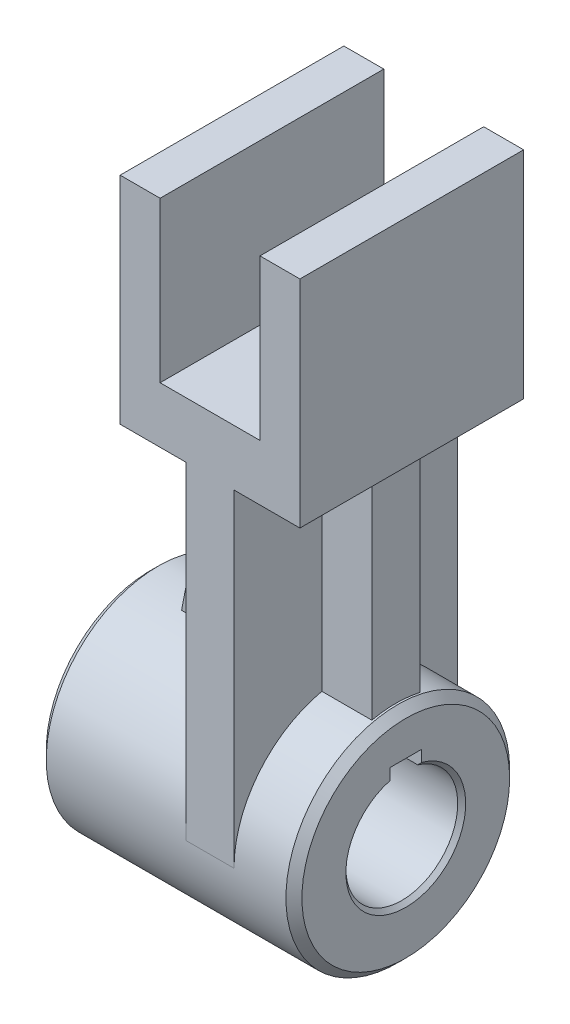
ISO-10303-21;
HEADER;
FILE_DESCRIPTION(('STEP AP214'),'2;1');
FILE_NAME('part.step','',(''),(''),'','','');
FILE_SCHEMA(('AUTOMOTIVE_DESIGN { 1 0 10303 214 1 1 1 1 }'));
ENDSEC;
DATA;
#1=APPLICATION_CONTEXT('core data for automotive mechanical design processes');
#2=APPLICATION_PROTOCOL_DEFINITION('international standard','automotive_design',2000,#1);
#3=PRODUCT_CONTEXT('',#1,'mechanical');
#4=PRODUCT('Part','Part','',(#3));
#5=PRODUCT_RELATED_PRODUCT_CATEGORY('part','',(#4));
#6=PRODUCT_DEFINITION_FORMATION('','',#4);
#7=PRODUCT_DEFINITION_CONTEXT('part definition',#1,'design');
#8=PRODUCT_DEFINITION('design','',#6,#7);
#9=PRODUCT_DEFINITION_SHAPE('','',#8);
#10=(LENGTH_UNIT() NAMED_UNIT(*) SI_UNIT(.MILLI.,.METRE.));
#11=(NAMED_UNIT(*) PLANE_ANGLE_UNIT() SI_UNIT($,.RADIAN.));
#12=(NAMED_UNIT(*) SI_UNIT($,.STERADIAN.) SOLID_ANGLE_UNIT());
#13=UNCERTAINTY_MEASURE_WITH_UNIT(LENGTH_MEASURE(1.E-05),#10,'distance_accuracy_value','');
#14=(GEOMETRIC_REPRESENTATION_CONTEXT(3) GLOBAL_UNCERTAINTY_ASSIGNED_CONTEXT((#13)) GLOBAL_UNIT_ASSIGNED_CONTEXT((#10,
#11,#12)) REPRESENTATION_CONTEXT('',''));
#15=CARTESIAN_POINT('',(0.,0.,0.));
#16=DIRECTION('',(0.,0.,1.));
#17=DIRECTION('',(1.,0.,0.));
#18=AXIS2_PLACEMENT_3D('',#15,#16,#17);
#19=CARTESIAN_POINT('',(-6.,0.,0.));
#20=DIRECTION('',(1.,0.,0.));
#21=DIRECTION('',(0.,0.,-1.));
#22=AXIS2_PLACEMENT_3D('',#19,#20,#21);
#23=PLANE('',#22);
#24=DIRECTION('',(0.,-1.,0.));
#25=VECTOR('',#24,1.);
#26=CARTESIAN_POINT('',(-6.,0.,-6.));
#27=LINE('',#26,#25);
#28=CARTESIAN_POINT('',(-6.,82.,-6.));
#29=VERTEX_POINT('',#28);
#30=CARTESIAN_POINT('',(-6.,27.3495886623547,-6.));
#31=VERTEX_POINT('',#30);
#32=EDGE_CURVE('E596',#29,#31,#27,.T.);
#33=ORIENTED_EDGE('',*,*,#32,.F.);
#34=DIRECTION('',(0.,0.,1.));
#35=VECTOR('',#34,1.);
#36=CARTESIAN_POINT('',(-6.,82.,-28.));
#37=LINE('',#36,#35);
#38=CARTESIAN_POINT('',(-6.,82.,-28.));
#39=VERTEX_POINT('',#38);
#40=EDGE_CURVE('E397',#39,#29,#37,.T.);
#41=ORIENTED_EDGE('',*,*,#40,.F.);
#42=DIRECTION('',(0.,1.,0.));
#43=VECTOR('',#42,1.);
#44=CARTESIAN_POINT('',(-6.,82.,-28.));
#45=LINE('',#44,#43);
#46=CARTESIAN_POINT('',(-6.,0.,-28.));
#47=VERTEX_POINT('',#46);
#48=EDGE_CURVE('E409',#47,#39,#45,.T.);
#49=ORIENTED_EDGE('',*,*,#48,.F.);
#50=CARTESIAN_POINT('',(-6.,0.,0.));
#51=DIRECTION('',(1.,0.,0.));
#52=DIRECTION('',(0.,0.,-1.));
#53=AXIS2_PLACEMENT_3D('',#50,#51,#52);
#54=CIRCLE('',#53,28.);
#55=EDGE_CURVE('E479',#47,#31,#54,.T.);
#56=ORIENTED_EDGE('',*,*,#55,.T.);
#57=EDGE_LOOP('',(#33,#41,#49,#56));
#58=FACE_BOUND('',#57,.T.);
#59=ADVANCED_FACE('F41',(#58),#23,.F.);
#60=CARTESIAN_POINT('',(6.,0.,0.));
#61=DIRECTION('',(1.,0.,0.));
#62=DIRECTION('',(0.,0.,-1.));
#63=AXIS2_PLACEMENT_3D('',#60,#61,#62);
#64=PLANE('',#63);
#65=DIRECTION('',(0.,0.,1.));
#66=VECTOR('',#65,1.);
#67=CARTESIAN_POINT('',(6.,82.,-28.));
#68=LINE('',#67,#66);
#69=CARTESIAN_POINT('',(6.,82.,-28.));
#70=VERTEX_POINT('',#69);
#71=CARTESIAN_POINT('',(6.,82.,-6.));
#72=VERTEX_POINT('',#71);
#73=EDGE_CURVE('E567',#70,#72,#68,.T.);
#74=ORIENTED_EDGE('',*,*,#73,.T.);
#75=DIRECTION('',(0.,-1.,0.));
#76=VECTOR('',#75,1.);
#77=CARTESIAN_POINT('',(6.,0.,-6.));
#78=LINE('',#77,#76);
#79=CARTESIAN_POINT('',(6.,27.3495886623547,-6.));
#80=VERTEX_POINT('',#79);
#81=EDGE_CURVE('E552',#72,#80,#78,.T.);
#82=ORIENTED_EDGE('',*,*,#81,.T.);
#83=CARTESIAN_POINT('',(6.,0.,0.));
#84=DIRECTION('',(1.,0.,0.));
#85=DIRECTION('',(0.,0.,-1.));
#86=AXIS2_PLACEMENT_3D('',#83,#84,#85);
#87=CIRCLE('',#86,28.);
#88=CARTESIAN_POINT('',(6.,0.,-28.));
#89=VERTEX_POINT('',#88);
#90=EDGE_CURVE('E398',#89,#80,#87,.T.);
#91=ORIENTED_EDGE('',*,*,#90,.F.);
#92=DIRECTION('',(0.,1.,0.));
#93=VECTOR('',#92,1.);
#94=CARTESIAN_POINT('',(6.,82.,-28.));
#95=LINE('',#94,#93);
#96=EDGE_CURVE('E406',#89,#70,#95,.T.);
#97=ORIENTED_EDGE('',*,*,#96,.T.);
#98=EDGE_LOOP('',(#74,#82,#91,#97));
#99=FACE_BOUND('',#98,.T.);
#100=ADVANCED_FACE('F361',(#99),#64,.T.);
#101=CARTESIAN_POINT('',(0.,82.,28.));
#102=DIRECTION('',(0.,1.,0.));
#103=DIRECTION('',(0.,0.,1.));
#104=AXIS2_PLACEMENT_3D('',#101,#102,#103);
#105=PLANE('',#104);
#106=DIRECTION('',(1.,0.,0.));
#107=VECTOR('',#106,1.);
#108=CARTESIAN_POINT('',(0.,82.,6.));
#109=LINE('',#108,#107);
#110=CARTESIAN_POINT('',(6.,82.,6.));
#111=VERTEX_POINT('',#110);
#112=CARTESIAN_POINT('',(18.5,82.,6.));
#113=VERTEX_POINT('',#112);
#114=EDGE_CURVE('E561',#111,#113,#109,.T.);
#115=ORIENTED_EDGE('',*,*,#114,.T.);
#116=DIRECTION('',(0.,0.,1.));
#117=VECTOR('',#116,1.);
#118=CARTESIAN_POINT('',(18.5,82.,28.));
#119=LINE('',#118,#117);
#120=CARTESIAN_POINT('',(18.5,82.,-6.));
#121=VERTEX_POINT('',#120);
#122=EDGE_CURVE('E564',#113,#121,#119,.F.);
#123=ORIENTED_EDGE('',*,*,#122,.T.);
#124=DIRECTION('',(1.,0.,0.));
#125=VECTOR('',#124,1.);
#126=CARTESIAN_POINT('',(0.,82.,-6.));
#127=LINE('',#126,#125);
#128=EDGE_CURVE('E555',#72,#121,#127,.T.);
#129=ORIENTED_EDGE('',*,*,#128,.F.);
#130=ORIENTED_EDGE('',*,*,#73,.F.);
#131=DIRECTION('',(1.,0.,0.));
#132=VECTOR('',#131,1.);
#133=CARTESIAN_POINT('',(0.,82.,-28.));
#134=LINE('',#133,#132);
#135=CARTESIAN_POINT('',(22.5,82.,-28.));
#136=VERTEX_POINT('',#135);
#137=EDGE_CURVE('E449',#70,#136,#134,.T.);
#138=ORIENTED_EDGE('',*,*,#137,.T.);
#139=DIRECTION('',(0.,0.,-1.));
#140=VECTOR('',#139,1.);
#141=CARTESIAN_POINT('',(22.5,82.,28.));
#142=LINE('',#141,#140);
#143=CARTESIAN_POINT('',(22.5,82.,28.));
#144=VERTEX_POINT('',#143);
#145=EDGE_CURVE('E470',#144,#136,#142,.T.);
#146=ORIENTED_EDGE('',*,*,#145,.F.);
#147=DIRECTION('',(1.,0.,0.));
#148=VECTOR('',#147,1.);
#149=CARTESIAN_POINT('',(0.,82.,28.));
#150=LINE('',#149,#148);
#151=CARTESIAN_POINT('',(6.,82.,28.));
#152=VERTEX_POINT('',#151);
#153=EDGE_CURVE('E428',#152,#144,#150,.T.);
#154=ORIENTED_EDGE('',*,*,#153,.F.);
#155=EDGE_CURVE('E412',#111,#152,#68,.T.);
#156=ORIENTED_EDGE('',*,*,#155,.F.);
#157=EDGE_LOOP('',(#115,#123,#129,#130,#138,#146,#154,#156));
#158=FACE_BOUND('',#157,.T.);
#159=ADVANCED_FACE('F368',(#158),#105,.F.);
#160=CARTESIAN_POINT('',(-12.5,0.,28.));
#161=DIRECTION('',(-1.,0.,0.));
#162=DIRECTION('',(0.,0.,1.));
#163=AXIS2_PLACEMENT_3D('',#160,#161,#162);
#164=PLANE('',#163);
#165=DIRECTION('',(0.,0.,-1.));
#166=VECTOR('',#165,1.);
#167=CARTESIAN_POINT('',(-12.5,96.,28.));
#168=LINE('',#167,#166);
#169=CARTESIAN_POINT('',(-12.5,96.,28.));
#170=VERTEX_POINT('',#169);
#171=CARTESIAN_POINT('',(-12.5,96.,-28.));
#172=VERTEX_POINT('',#171);
#173=EDGE_CURVE('E440',#170,#172,#168,.T.);
#174=ORIENTED_EDGE('',*,*,#173,.T.);
#175=DIRECTION('',(0.,1.,0.));
#176=VECTOR('',#175,1.);
#177=CARTESIAN_POINT('',(-12.5,0.,-28.));
#178=LINE('',#177,#176);
#179=CARTESIAN_POINT('',(-12.5,136.,-28.));
#180=VERTEX_POINT('',#179);
#181=EDGE_CURVE('E419',#172,#180,#178,.T.);
#182=ORIENTED_EDGE('',*,*,#181,.T.);
#183=DIRECTION('',(0.,0.,-1.));
#184=VECTOR('',#183,1.);
#185=CARTESIAN_POINT('',(-12.5,136.,28.));
#186=LINE('',#185,#184);
#187=CARTESIAN_POINT('',(-12.5,136.,28.));
#188=VERTEX_POINT('',#187);
#189=EDGE_CURVE('E476',#188,#180,#186,.T.);
#190=ORIENTED_EDGE('',*,*,#189,.F.);
#191=DIRECTION('',(0.,1.,0.));
#192=VECTOR('',#191,1.);
#193=CARTESIAN_POINT('',(-12.5,0.,28.));
#194=LINE('',#193,#192);
#195=EDGE_CURVE('E420',#170,#188,#194,.T.);
#196=ORIENTED_EDGE('',*,*,#195,.F.);
#197=EDGE_LOOP('',(#174,#182,#190,#196));
#198=FACE_BOUND('',#197,.T.);
#199=ADVANCED_FACE('F610',(#198),#164,.F.);
#200=CARTESIAN_POINT('',(0.,136.,28.));
#201=DIRECTION('',(0.,-1.,0.));
#202=DIRECTION('',(0.,0.,-1.));
#203=AXIS2_PLACEMENT_3D('',#200,#201,#202);
#204=PLANE('',#203);
#205=ORIENTED_EDGE('',*,*,#189,.T.);
#206=DIRECTION('',(-1.,0.,0.));
#207=VECTOR('',#206,1.);
#208=CARTESIAN_POINT('',(0.,136.,-28.));
#209=LINE('',#208,#207);
#210=CARTESIAN_POINT('',(-22.5,136.,-28.));
#211=VERTEX_POINT('',#210);
#212=EDGE_CURVE('E443',#180,#211,#209,.T.);
#213=ORIENTED_EDGE('',*,*,#212,.T.);
#214=DIRECTION('',(0.,0.,-1.));
#215=VECTOR('',#214,1.);
#216=CARTESIAN_POINT('',(-22.5,136.,28.));
#217=LINE('',#216,#215);
#218=CARTESIAN_POINT('',(-22.5,136.,28.));
#219=VERTEX_POINT('',#218);
#220=EDGE_CURVE('E474',#219,#211,#217,.T.);
#221=ORIENTED_EDGE('',*,*,#220,.F.);
#222=DIRECTION('',(-1.,0.,0.));
#223=VECTOR('',#222,1.);
#224=CARTESIAN_POINT('',(0.,136.,28.));
#225=LINE('',#224,#223);
#226=EDGE_CURVE('E423',#188,#219,#225,.T.);
#227=ORIENTED_EDGE('',*,*,#226,.F.);
#228=EDGE_LOOP('',(#205,#213,#221,#227));
#229=FACE_BOUND('',#228,.T.);
#230=ADVANCED_FACE('F606',(#229),#204,.F.);
#231=CARTESIAN_POINT('',(-22.5,0.,28.));
#232=DIRECTION('',(1.,0.,0.));
#233=DIRECTION('',(0.,1.,0.));
#234=AXIS2_PLACEMENT_3D('',#231,#232,#233);
#235=PLANE('',#234);
#236=ORIENTED_EDGE('',*,*,#220,.T.);
#237=DIRECTION('',(0.,-1.,0.));
#238=VECTOR('',#237,1.);
#239=CARTESIAN_POINT('',(-22.5,0.,-28.));
#240=LINE('',#239,#238);
#241=CARTESIAN_POINT('',(-22.5,82.,-28.));
#242=VERTEX_POINT('',#241);
#243=EDGE_CURVE('E446',#211,#242,#240,.T.);
#244=ORIENTED_EDGE('',*,*,#243,.T.);
#245=DIRECTION('',(0.,0.,-1.));
#246=VECTOR('',#245,1.);
#247=CARTESIAN_POINT('',(-22.5,82.,28.));
#248=LINE('',#247,#246);
#249=CARTESIAN_POINT('',(-22.5,82.,28.));
#250=VERTEX_POINT('',#249);
#251=EDGE_CURVE('E472',#250,#242,#248,.T.);
#252=ORIENTED_EDGE('',*,*,#251,.F.);
#253=DIRECTION('',(0.,-1.,0.));
#254=VECTOR('',#253,1.);
#255=CARTESIAN_POINT('',(-22.5,0.,28.));
#256=LINE('',#255,#254);
#257=EDGE_CURVE('E426',#219,#250,#256,.T.);
#258=ORIENTED_EDGE('',*,*,#257,.F.);
#259=EDGE_LOOP('',(#236,#244,#252,#258));
#260=FACE_BOUND('',#259,.T.);
#261=ADVANCED_FACE('F603',(#260),#235,.F.);
#262=DIRECTION('',(0.,0.,1.));
#263=VECTOR('',#262,1.);
#264=CARTESIAN_POINT('',(-18.5,82.,28.));
#265=LINE('',#264,#263);
#266=CARTESIAN_POINT('',(-18.5,82.,-6.));
#267=VERTEX_POINT('',#266);
#268=CARTESIAN_POINT('',(-18.5,82.,6.));
#269=VERTEX_POINT('',#268);
#270=EDGE_CURVE('E530',#267,#269,#265,.T.);
#271=ORIENTED_EDGE('',*,*,#270,.T.);
#272=DIRECTION('',(1.,0.,0.));
#273=VECTOR('',#272,1.);
#274=CARTESIAN_POINT('',(0.,82.,6.));
#275=LINE('',#274,#273);
#276=CARTESIAN_POINT('',(-6.,82.,6.));
#277=VERTEX_POINT('',#276);
#278=EDGE_CURVE('E525',#269,#277,#275,.T.);
#279=ORIENTED_EDGE('',*,*,#278,.T.);
#280=CARTESIAN_POINT('',(-6.,82.,28.));
#281=VERTEX_POINT('',#280);
#282=EDGE_CURVE('E388',#277,#281,#37,.T.);
#283=ORIENTED_EDGE('',*,*,#282,.T.);
#284=EDGE_CURVE('E429',#250,#281,#150,.T.);
#285=ORIENTED_EDGE('',*,*,#284,.F.);
#286=ORIENTED_EDGE('',*,*,#251,.T.);
#287=EDGE_CURVE('E450',#242,#39,#134,.T.);
#288=ORIENTED_EDGE('',*,*,#287,.T.);
#289=ORIENTED_EDGE('',*,*,#40,.T.);
#290=DIRECTION('',(1.,0.,0.));
#291=VECTOR('',#290,1.);
#292=CARTESIAN_POINT('',(0.,82.,-6.));
#293=LINE('',#292,#291);
#294=EDGE_CURVE('E540',#267,#29,#293,.T.);
#295=ORIENTED_EDGE('',*,*,#294,.F.);
#296=EDGE_LOOP('',(#271,#279,#283,#285,#286,#288,#289,#295));
#297=FACE_BOUND('',#296,.T.);
#298=ADVANCED_FACE('F539',(#297),#105,.F.);
#299=CARTESIAN_POINT('',(22.5,0.,28.));
#300=DIRECTION('',(-1.,0.,0.));
#301=DIRECTION('',(0.,-1.,0.));
#302=AXIS2_PLACEMENT_3D('',#299,#300,#301);
#303=PLANE('',#302);
#304=ORIENTED_EDGE('',*,*,#145,.T.);
#305=DIRECTION('',(0.,1.,0.));
#306=VECTOR('',#305,1.);
#307=CARTESIAN_POINT('',(22.5,0.,-28.));
#308=LINE('',#307,#306);
#309=CARTESIAN_POINT('',(22.5,136.,-28.));
#310=VERTEX_POINT('',#309);
#311=EDGE_CURVE('E452',#136,#310,#308,.T.);
#312=ORIENTED_EDGE('',*,*,#311,.T.);
#313=DIRECTION('',(0.,0.,-1.));
#314=VECTOR('',#313,1.);
#315=CARTESIAN_POINT('',(22.5,136.,28.));
#316=LINE('',#315,#314);
#317=CARTESIAN_POINT('',(22.5,136.,28.));
#318=VERTEX_POINT('',#317);
#319=EDGE_CURVE('E468',#318,#310,#316,.T.);
#320=ORIENTED_EDGE('',*,*,#319,.F.);
#321=DIRECTION('',(0.,1.,0.));
#322=VECTOR('',#321,1.);
#323=CARTESIAN_POINT('',(22.5,0.,28.));
#324=LINE('',#323,#322);
#325=EDGE_CURVE('E431',#144,#318,#324,.T.);
#326=ORIENTED_EDGE('',*,*,#325,.F.);
#327=EDGE_LOOP('',(#304,#312,#320,#326));
#328=FACE_BOUND('',#327,.T.);
#329=ADVANCED_FACE('F626',(#328),#303,.F.);
#330=CARTESIAN_POINT('',(0.,136.,28.));
#331=DIRECTION('',(0.,-1.,0.));
#332=DIRECTION('',(0.,0.,-1.));
#333=AXIS2_PLACEMENT_3D('',#330,#331,#332);
#334=PLANE('',#333);
#335=ORIENTED_EDGE('',*,*,#319,.T.);
#336=DIRECTION('',(-1.,0.,0.));
#337=VECTOR('',#336,1.);
#338=CARTESIAN_POINT('',(0.,136.,-28.));
#339=LINE('',#338,#337);
#340=CARTESIAN_POINT('',(12.5,136.,-28.));
#341=VERTEX_POINT('',#340);
#342=EDGE_CURVE('E455',#310,#341,#339,.T.);
#343=ORIENTED_EDGE('',*,*,#342,.T.);
#344=DIRECTION('',(0.,0.,-1.));
#345=VECTOR('',#344,1.);
#346=CARTESIAN_POINT('',(12.5,136.,28.));
#347=LINE('',#346,#345);
#348=CARTESIAN_POINT('',(12.5,136.,28.));
#349=VERTEX_POINT('',#348);
#350=EDGE_CURVE('E466',#349,#341,#347,.T.);
#351=ORIENTED_EDGE('',*,*,#350,.F.);
#352=DIRECTION('',(-1.,0.,0.));
#353=VECTOR('',#352,1.);
#354=CARTESIAN_POINT('',(0.,136.,28.));
#355=LINE('',#354,#353);
#356=EDGE_CURVE('E433',#318,#349,#355,.T.);
#357=ORIENTED_EDGE('',*,*,#356,.F.);
#358=EDGE_LOOP('',(#335,#343,#351,#357));
#359=FACE_BOUND('',#358,.T.);
#360=ADVANCED_FACE('F623',(#359),#334,.F.);
#361=CARTESIAN_POINT('',(12.5,0.,28.));
#362=DIRECTION('',(-1.,0.,0.));
#363=DIRECTION('',(0.,0.,1.));
#364=AXIS2_PLACEMENT_3D('',#361,#362,#363);
#365=PLANE('',#364);
#366=ORIENTED_EDGE('',*,*,#350,.T.);
#367=DIRECTION('',(0.,1.,0.));
#368=VECTOR('',#367,1.);
#369=CARTESIAN_POINT('',(12.5,0.,-28.));
#370=LINE('',#369,#368);
#371=CARTESIAN_POINT('',(12.5,96.,-28.));
#372=VERTEX_POINT('',#371);
#373=EDGE_CURVE('E458',#372,#341,#370,.T.);
#374=ORIENTED_EDGE('',*,*,#373,.F.);
#375=DIRECTION('',(0.,0.,-1.));
#376=VECTOR('',#375,1.);
#377=CARTESIAN_POINT('',(12.5,96.,28.));
#378=LINE('',#377,#376);
#379=CARTESIAN_POINT('',(12.5,96.,28.));
#380=VERTEX_POINT('',#379);
#381=EDGE_CURVE('E464',#380,#372,#378,.T.);
#382=ORIENTED_EDGE('',*,*,#381,.F.);
#383=DIRECTION('',(0.,1.,0.));
#384=VECTOR('',#383,1.);
#385=CARTESIAN_POINT('',(12.5,0.,28.));
#386=LINE('',#385,#384);
#387=EDGE_CURVE('E435',#380,#349,#386,.T.);
#388=ORIENTED_EDGE('',*,*,#387,.T.);
#389=EDGE_LOOP('',(#366,#374,#382,#388));
#390=FACE_BOUND('',#389,.T.);
#391=ADVANCED_FACE('F618',(#390),#365,.T.);
#392=CARTESIAN_POINT('',(0.,96.,28.));
#393=DIRECTION('',(0.,-1.,0.));
#394=DIRECTION('',(0.,0.,-1.));
#395=AXIS2_PLACEMENT_3D('',#392,#393,#394);
#396=PLANE('',#395);
#397=ORIENTED_EDGE('',*,*,#381,.T.);
#398=DIRECTION('',(-1.,0.,0.));
#399=VECTOR('',#398,1.);
#400=CARTESIAN_POINT('',(0.,96.,-28.));
#401=LINE('',#400,#399);
#402=EDGE_CURVE('E424',#372,#172,#401,.T.);
#403=ORIENTED_EDGE('',*,*,#402,.T.);
#404=ORIENTED_EDGE('',*,*,#173,.F.);
#405=DIRECTION('',(-1.,0.,0.));
#406=VECTOR('',#405,1.);
#407=CARTESIAN_POINT('',(0.,96.,28.));
#408=LINE('',#407,#406);
#409=EDGE_CURVE('E438',#380,#170,#408,.T.);
#410=ORIENTED_EDGE('',*,*,#409,.F.);
#411=EDGE_LOOP('',(#397,#403,#404,#410));
#412=FACE_BOUND('',#411,.T.);
#413=ADVANCED_FACE('F615',(#412),#396,.F.);
#414=CARTESIAN_POINT('',(0.,0.,28.));
#415=DIRECTION('',(0.,0.,1.));
#416=DIRECTION('',(1.,0.,0.));
#417=AXIS2_PLACEMENT_3D('',#414,#415,#416);
#418=PLANE('',#417);
#419=ORIENTED_EDGE('',*,*,#195,.T.);
#420=ORIENTED_EDGE('',*,*,#226,.T.);
#421=ORIENTED_EDGE('',*,*,#257,.T.);
#422=ORIENTED_EDGE('',*,*,#284,.T.);
#423=DIRECTION('',(0.,-1.,0.));
#424=VECTOR('',#423,1.);
#425=CARTESIAN_POINT('',(-6.,82.,28.));
#426=LINE('',#425,#424);
#427=CARTESIAN_POINT('',(-6.,0.,28.));
#428=VERTEX_POINT('',#427);
#429=EDGE_CURVE('E392',#281,#428,#426,.T.);
#430=ORIENTED_EDGE('',*,*,#429,.T.);
#431=DIRECTION('',(-1.,0.,0.));
#432=VECTOR('',#431,1.);
#433=CARTESIAN_POINT('',(6.,0.,28.));
#434=LINE('',#433,#432);
#435=CARTESIAN_POINT('',(6.,0.,28.));
#436=VERTEX_POINT('',#435);
#437=EDGE_CURVE('E416',#436,#428,#434,.T.);
#438=ORIENTED_EDGE('',*,*,#437,.F.);
#439=DIRECTION('',(0.,-1.,0.));
#440=VECTOR('',#439,1.);
#441=CARTESIAN_POINT('',(6.,82.,28.));
#442=LINE('',#441,#440);
#443=EDGE_CURVE('E569',#152,#436,#442,.T.);
#444=ORIENTED_EDGE('',*,*,#443,.F.);
#445=ORIENTED_EDGE('',*,*,#153,.T.);
#446=ORIENTED_EDGE('',*,*,#325,.T.);
#447=ORIENTED_EDGE('',*,*,#356,.T.);
#448=ORIENTED_EDGE('',*,*,#387,.F.);
#449=ORIENTED_EDGE('',*,*,#409,.T.);
#450=EDGE_LOOP('',(#419,#420,#421,#422,#430,#438,#444,#445,#446,#447,#448,#449));
#451=FACE_BOUND('',#450,.T.);
#452=ADVANCED_FACE('F628',(#451),#418,.T.);
#453=CARTESIAN_POINT('',(0.,0.,-28.));
#454=DIRECTION('',(0.,0.,1.));
#455=DIRECTION('',(1.,0.,0.));
#456=AXIS2_PLACEMENT_3D('',#453,#454,#455);
#457=PLANE('',#456);
#458=ORIENTED_EDGE('',*,*,#181,.F.);
#459=ORIENTED_EDGE('',*,*,#402,.F.);
#460=ORIENTED_EDGE('',*,*,#373,.T.);
#461=ORIENTED_EDGE('',*,*,#342,.F.);
#462=ORIENTED_EDGE('',*,*,#311,.F.);
#463=ORIENTED_EDGE('',*,*,#137,.F.);
#464=ORIENTED_EDGE('',*,*,#96,.F.);
#465=DIRECTION('',(-1.,0.,0.));
#466=VECTOR('',#465,1.);
#467=CARTESIAN_POINT('',(6.,0.,-28.));
#468=LINE('',#467,#466);
#469=EDGE_CURVE('E413',#89,#47,#468,.T.);
#470=ORIENTED_EDGE('',*,*,#469,.T.);
#471=ORIENTED_EDGE('',*,*,#48,.T.);
#472=ORIENTED_EDGE('',*,*,#287,.F.);
#473=ORIENTED_EDGE('',*,*,#243,.F.);
#474=ORIENTED_EDGE('',*,*,#212,.F.);
#475=EDGE_LOOP('',(#458,#459,#460,#461,#462,#463,#464,#470,#471,#472,#473,#474));
#476=FACE_BOUND('',#475,.T.);
#477=ADVANCED_FACE('F383',(#476),#457,.F.);
#478=DIRECTION('',(0.,-1.,0.));
#479=VECTOR('',#478,1.);
#480=CARTESIAN_POINT('',(6.,0.,6.));
#481=LINE('',#480,#479);
#482=CARTESIAN_POINT('',(6.,27.3495886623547,6.));
#483=VERTEX_POINT('',#482);
#484=EDGE_CURVE('E559',#111,#483,#481,.T.);
#485=ORIENTED_EDGE('',*,*,#484,.F.);
#486=ORIENTED_EDGE('',*,*,#155,.T.);
#487=ORIENTED_EDGE('',*,*,#443,.T.);
#488=EDGE_CURVE('E402',#483,#436,#87,.T.);
#489=ORIENTED_EDGE('',*,*,#488,.F.);
#490=EDGE_LOOP('',(#485,#486,#487,#489));
#491=FACE_BOUND('',#490,.T.);
#492=ADVANCED_FACE('F371',(#491),#64,.T.);
#493=ORIENTED_EDGE('',*,*,#282,.F.);
#494=DIRECTION('',(0.,-1.,0.));
#495=VECTOR('',#494,1.);
#496=CARTESIAN_POINT('',(-6.,0.,6.));
#497=LINE('',#496,#495);
#498=CARTESIAN_POINT('',(-6.,27.3495886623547,6.));
#499=VERTEX_POINT('',#498);
#500=EDGE_CURVE('E389',#277,#499,#497,.T.);
#501=ORIENTED_EDGE('',*,*,#500,.T.);
#502=EDGE_CURVE('E478',#499,#428,#54,.T.);
#503=ORIENTED_EDGE('',*,*,#502,.T.);
#504=ORIENTED_EDGE('',*,*,#429,.F.);
#505=EDGE_LOOP('',(#493,#501,#503,#504));
#506=FACE_BOUND('',#505,.T.);
#507=ADVANCED_FACE('F364',(#506),#23,.F.);
#508=CARTESIAN_POINT('',(-43.,0.,0.));
#509=DIRECTION('',(1.,0.,0.));
#510=DIRECTION('',(0.,0.,-1.));
#511=AXIS2_PLACEMENT_3D('',#508,#509,#510);
#512=CYLINDRICAL_SURFACE('',#511,28.);
#513=CARTESIAN_POINT('',(19.,0.,0.));
#514=DIRECTION('',(1.,0.,0.));
#515=DIRECTION('',(0.,0.,-1.));
#516=AXIS2_PLACEMENT_3D('',#513,#514,#515);
#517=CIRCLE('',#516,28.);
#518=CARTESIAN_POINT('',(19.,0.,-28.));
#519=VERTEX_POINT('',#518);
#520=EDGE_CURVE('E50',#519,#519,#517,.F.);
#521=ORIENTED_EDGE('',*,*,#520,.T.);
#522=EDGE_LOOP('',(#521));
#523=FACE_BOUND('',#522,.T.);
#524=CARTESIAN_POINT('',(-40.9999999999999,0.,0.));
#525=DIRECTION('',(1.,0.,0.));
#526=DIRECTION('',(0.,0.,-1.));
#527=AXIS2_PLACEMENT_3D('',#524,#525,#526);
#528=CIRCLE('',#527,28.);
#529=CARTESIAN_POINT('',(-40.9999999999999,0.,-28.));
#530=VERTEX_POINT('',#529);
#531=EDGE_CURVE('E763',#530,#530,#528,.T.);
#532=ORIENTED_EDGE('',*,*,#531,.T.);
#533=EDGE_LOOP('',(#532));
#534=FACE_BOUND('',#533,.T.);
#535=CARTESIAN_POINT('',(-10.,-28.,0.));
#536=CARTESIAN_POINT('',(-10.0008653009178,-28.,-2.37854167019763E-08));
#537=CARTESIAN_POINT('',(-10.0017306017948,-27.9999999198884,-0.00203325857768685));
#538=CARTESIAN_POINT('',(-10.0040424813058,-27.9999994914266,-0.00640658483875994));
#539=CARTESIAN_POINT('',(-10.0054887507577,-27.99999899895,-0.00803399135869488));
#540=CARTESIAN_POINT('',(-10.0110633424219,-27.9999962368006,-0.0148703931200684));
#541=CARTESIAN_POINT('',(-10.0151926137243,-27.9999923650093,-0.0211254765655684));
#542=CARTESIAN_POINT('',(-10.0660021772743,-27.9999222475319,-0.0974123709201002));
#543=CARTESIAN_POINT('',(-10.1126760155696,-27.9996243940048,-0.160424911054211));
#544=CARTESIAN_POINT('',(-10.2047852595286,-27.9985759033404,-0.288565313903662));
#545=CARTESIAN_POINT('',(-10.2502206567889,-27.9978374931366,-0.353592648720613));
#546=CARTESIAN_POINT('',(-10.3402985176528,-27.9959348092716,-0.481545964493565));
#547=CARTESIAN_POINT('',(-10.3849410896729,-27.9947781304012,-0.544488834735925));
#548=CARTESIAN_POINT('',(-10.4745397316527,-27.992027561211,-0.671071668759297));
#549=CARTESIAN_POINT('',(-10.5194957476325,-27.9904305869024,-0.734713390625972));
#550=CARTESIAN_POINT('',(-10.6524711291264,-27.9850649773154,-0.922904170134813));
#551=CARTESIAN_POINT('',(-10.7404762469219,-27.9806817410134,-1.04738031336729));
#552=CARTESIAN_POINT('',(-10.9170737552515,-27.9702132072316,-1.29726355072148));
#553=CARTESIAN_POINT('',(-11.0056657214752,-27.9641156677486,-1.42267077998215));
#554=CARTESIAN_POINT('',(-11.1809920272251,-27.9503703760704,-1.67091231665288));
#555=CARTESIAN_POINT('',(-11.2677279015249,-27.9427562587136,-1.79374765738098));
#556=CARTESIAN_POINT('',(-11.4409387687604,-27.9259201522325,-2.03913587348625));
#557=CARTESIAN_POINT('',(-11.5274139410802,-27.9167013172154,-2.16168883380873));
#558=CARTESIAN_POINT('',(-11.7881388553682,-27.8864448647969,-2.53133889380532));
#559=CARTESIAN_POINT('',(-11.9622227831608,-27.8629218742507,-2.77835320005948));
#560=CARTESIAN_POINT('',(-12.3246758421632,-27.8069665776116,-3.29321758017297));
#561=CARTESIAN_POINT('',(-12.512991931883,-27.7739439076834,-3.56104084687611));
#562=CARTESIAN_POINT('',(-12.888346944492,-27.7001445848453,-4.0956886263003));
#563=CARTESIAN_POINT('',(-13.0753876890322,-27.6593838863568,-4.36251406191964));
#564=CARTESIAN_POINT('',(-13.4499168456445,-27.5696521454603,-4.89780903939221));
#565=CARTESIAN_POINT('',(-13.637396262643,-27.5206162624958,-5.16627402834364));
#566=CARTESIAN_POINT('',(-14.0111315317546,-27.4144913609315,-5.70267028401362));
#567=CARTESIAN_POINT('',(-14.1973866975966,-27.3573981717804,-5.97060120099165));
#568=CARTESIAN_POINT('',(-14.6811649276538,-27.197929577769,-6.66838901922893));
#569=CARTESIAN_POINT('',(-14.977476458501,-27.0891301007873,-7.09763744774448));
#570=CARTESIAN_POINT('',(-15.5646072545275,-26.8505011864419,-7.95281693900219));
#571=CARTESIAN_POINT('',(-15.8554356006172,-26.7207107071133,-8.37875264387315));
#572=CARTESIAN_POINT('',(-16.4263066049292,-26.4419369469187,-9.22047887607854));
#573=CARTESIAN_POINT('',(-16.7064482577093,-26.2933100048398,-9.63632010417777));
#574=CARTESIAN_POINT('',(-17.2599564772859,-25.9747665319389,-10.4646295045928));
#575=CARTESIAN_POINT('',(-17.5333203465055,-25.8048416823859,-10.877096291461));
#576=CARTESIAN_POINT('',(-17.9938472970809,-25.4957142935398,-11.5788574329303));
#577=CARTESIAN_POINT('',(-18.1830293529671,-25.361882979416,-11.8692004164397));
#578=CARTESIAN_POINT('',(-18.556771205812,-25.0831404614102,-12.4474525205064));
#579=CARTESIAN_POINT('',(-18.7413316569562,-24.9382308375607,-12.7353619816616));
#580=CARTESIAN_POINT('',(-19.2887927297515,-24.4853853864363,-13.5973666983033));
#581=CARTESIAN_POINT('',(-19.6439983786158,-24.1603143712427,-14.1674990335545));
#582=CARTESIAN_POINT('',(-20.3416592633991,-23.4502395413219,-15.3153056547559));
#583=CARTESIAN_POINT('',(-20.6831457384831,-23.0634534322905,-15.8924689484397));
#584=CARTESIAN_POINT('',(-21.3316515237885,-22.2382430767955,-17.0279851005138));
#585=CARTESIAN_POINT('',(-21.6387139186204,-21.7998848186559,-17.5863608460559));
#586=CARTESIAN_POINT('',(-22.1319794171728,-20.9979751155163,-18.5298687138));
#587=CARTESIAN_POINT('',(-22.3282084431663,-20.6469637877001,-18.9204469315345));
#588=CARTESIAN_POINT('',(-22.694787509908,-19.9168602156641,-19.6875338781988));
#589=CARTESIAN_POINT('',(-22.8651335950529,-19.5377636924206,-20.0640404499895));
#590=CARTESIAN_POINT('',(-23.174265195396,-18.7554245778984,-20.797087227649));
#591=CARTESIAN_POINT('',(-23.3133188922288,-18.3524277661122,-21.1537756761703));
#592=CARTESIAN_POINT('',(-23.5571056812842,-17.5203279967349,-21.8479149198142));
#593=CARTESIAN_POINT('',(-23.6618485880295,-17.0912325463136,-22.1853711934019));
#594=CARTESIAN_POINT('',(-23.8134518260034,-16.3048210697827,-22.7670231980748));
#595=CARTESIAN_POINT('',(-23.8679442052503,-15.9521694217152,-23.0155497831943));
#596=CARTESIAN_POINT('',(-23.9502364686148,-15.2335524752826,-23.4973597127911));
#597=CARTESIAN_POINT('',(-23.9780389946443,-14.8675884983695,-23.7306445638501));
#598=CARTESIAN_POINT('',(-24.0043994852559,-14.123944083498,-24.1806384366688));
#599=CARTESIAN_POINT('',(-24.0029235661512,-13.7462505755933,-24.3973279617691));
#600=CARTESIAN_POINT('',(-23.9681913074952,-12.9822413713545,-24.8123023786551));
#601=CARTESIAN_POINT('',(-23.9349346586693,-12.5959255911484,-25.0105870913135));
#602=CARTESIAN_POINT('',(-23.8340892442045,-11.8150187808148,-25.3888752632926));
#603=CARTESIAN_POINT('',(-23.7662352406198,-11.4203867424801,-25.5687243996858));
#604=CARTESIAN_POINT('',(-23.5943370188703,-10.629900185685,-25.9073365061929));
#605=CARTESIAN_POINT('',(-23.4902923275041,-10.2340456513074,-26.0660992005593));
#606=CARTESIAN_POINT('',(-23.2450709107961,-9.4460773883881,-26.3618776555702));
#607=CARTESIAN_POINT('',(-23.1039232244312,-9.05396098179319,-26.498910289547));
#608=CARTESIAN_POINT('',(-22.784222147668,-8.27814657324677,-26.7514234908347));
#609=CARTESIAN_POINT('',(-22.6056738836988,-7.89444742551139,-26.8669070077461));
#610=CARTESIAN_POINT('',(-22.2379993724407,-7.19063597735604,-27.0630746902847));
#611=CARTESIAN_POINT('',(-22.0534331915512,-6.868850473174,-27.1463440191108));
#612=CARTESIAN_POINT('',(-21.6575455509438,-6.23855112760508,-27.2980865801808));
#613=CARTESIAN_POINT('',(-21.4462267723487,-5.93003596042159,-27.3665612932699));
#614=CARTESIAN_POINT('',(-20.998105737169,-5.32923710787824,-27.4898765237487));
#615=CARTESIAN_POINT('',(-20.7613038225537,-5.03695320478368,-27.5447172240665));
#616=CARTESIAN_POINT('',(-20.2638044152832,-4.47129664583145,-27.6421760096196));
#617=CARTESIAN_POINT('',(-20.0031065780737,-4.19792426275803,-27.6847939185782));
#618=CARTESIAN_POINT('',(-19.4678226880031,-3.68037002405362,-27.7582628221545));
#619=CARTESIAN_POINT('',(-19.1938875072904,-3.43555866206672,-27.7894283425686));
#620=CARTESIAN_POINT('',(-18.6271260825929,-2.96787969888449,-27.8432596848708));
#621=CARTESIAN_POINT('',(-18.3343004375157,-2.74501140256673,-27.8659257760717));
#622=CARTESIAN_POINT('',(-17.7316807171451,-2.3228223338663,-27.9042908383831));
#623=CARTESIAN_POINT('',(-17.4218852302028,-2.12350352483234,-27.9199892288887));
#624=CARTESIAN_POINT('',(-16.7873748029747,-1.74981147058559,-27.9458986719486));
#625=CARTESIAN_POINT('',(-16.4626593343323,-1.57543910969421,-27.956109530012));
#626=CARTESIAN_POINT('',(-15.7870123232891,-1.24628125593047,-27.9727554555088));
#627=CARTESIAN_POINT('',(-15.4355516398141,-1.09257249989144,-27.9790212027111));
#628=CARTESIAN_POINT('',(-14.7211674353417,-0.814496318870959,-27.9884969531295));
#629=CARTESIAN_POINT('',(-14.3582436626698,-0.690129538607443,-27.9917068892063));
#630=CARTESIAN_POINT('',(-13.6233664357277,-0.471578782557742,-27.9962421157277));
#631=CARTESIAN_POINT('',(-13.2514120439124,-0.377397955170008,-27.9975672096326));
#632=CARTESIAN_POINT('',(-12.5010272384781,-0.219875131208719,-27.999247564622));
#633=CARTESIAN_POINT('',(-12.1225967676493,-0.156533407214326,-27.9996028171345));
#634=CARTESIAN_POINT('',(-11.3526228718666,-0.0599654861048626,-27.9999787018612));
#635=CARTESIAN_POINT('',(-10.9609834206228,-0.0275031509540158,-27.999991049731));
#636=CARTESIAN_POINT('',(-10.1763572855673,0.00439461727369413,-28.0000041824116));
#637=CARTESIAN_POINT('',(-9.78337057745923,0.00382945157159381,-28.0000049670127));
#638=CARTESIAN_POINT('',(-8.99881305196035,-0.0303255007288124,-27.9999887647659));
#639=CARTESIAN_POINT('',(-8.60724231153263,-0.0639170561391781,-27.9999717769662));
#640=CARTESIAN_POINT('',(-7.82831054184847,-0.163889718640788,-27.9995648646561));
#641=CARTESIAN_POINT('',(-7.44094950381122,-0.230270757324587,-27.9991749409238));
#642=CARTESIAN_POINT('',(-6.67223994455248,-0.395554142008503,-27.997328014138));
#643=CARTESIAN_POINT('',(-6.29090841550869,-0.49453550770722,-27.9958684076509));
#644=CARTESIAN_POINT('',(-5.53794863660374,-0.724269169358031,-27.990866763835));
#645=CARTESIAN_POINT('',(-5.16632044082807,-0.855021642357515,-27.9873247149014));
#646=CARTESIAN_POINT('',(-4.43541123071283,-1.14736277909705,-27.9768643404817));
#647=CARTESIAN_POINT('',(-4.07613110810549,-1.30895366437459,-27.9699457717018));
#648=CARTESIAN_POINT('',(-3.37255823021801,-1.66177146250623,-27.9512022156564));
#649=CARTESIAN_POINT('',(-3.02826538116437,-1.85299818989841,-27.9393772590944));
#650=CARTESIAN_POINT('',(-2.35870367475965,-2.26271137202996,-27.9091763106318));
#651=CARTESIAN_POINT('',(-2.03335695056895,-2.48107268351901,-27.8908297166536));
#652=CARTESIAN_POINT('',(-1.40246389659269,-2.94398614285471,-27.8457716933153));
#653=CARTESIAN_POINT('',(-1.09691755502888,-3.18853827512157,-27.819060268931));
#654=CARTESIAN_POINT('',(-0.508025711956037,-3.70170360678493,-27.7554353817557));
#655=CARTESIAN_POINT('',(-0.224673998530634,-3.97031002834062,-27.7185247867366));
#656=CARTESIAN_POINT('',(0.317762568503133,-4.52923377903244,-27.6326970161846));
#657=CARTESIAN_POINT('',(0.576848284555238,-4.81955033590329,-27.5837802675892));
#658=CARTESIAN_POINT('',(1.06092928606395,-5.40949762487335,-27.4740681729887));
#659=CARTESIAN_POINT('',(1.28675220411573,-5.70852975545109,-27.4137047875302));
#660=CARTESIAN_POINT('',(1.71240575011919,-6.32153807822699,-27.2788675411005));
#661=CARTESIAN_POINT('',(1.91223705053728,-6.63551388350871,-27.2043940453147));
#662=CARTESIAN_POINT('',(2.28473652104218,-7.27525370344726,-27.0403342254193));
#663=CARTESIAN_POINT('',(2.45741376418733,-7.60101373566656,-26.9507529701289));
#664=CARTESIAN_POINT('',(2.77499359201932,-8.26120973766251,-26.7557630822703));
#665=CARTESIAN_POINT('',(2.9198966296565,-8.59564556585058,-26.6503547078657));
#666=CARTESIAN_POINT('',(3.1773986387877,-9.25884708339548,-26.4271096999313));
#667=CARTESIAN_POINT('',(3.29090243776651,-9.58743813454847,-26.3097950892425));
#668=CARTESIAN_POINT('',(3.49193296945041,-10.246796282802,-26.0600735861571));
#669=CARTESIAN_POINT('',(3.57946046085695,-10.5775633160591,-25.9276671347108));
#670=CARTESIAN_POINT('',(3.72917002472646,-11.2386917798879,-25.6480152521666));
#671=CARTESIAN_POINT('',(3.79134231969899,-11.5690530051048,-25.5007641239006));
#672=CARTESIAN_POINT('',(3.89123420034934,-12.2267874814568,-25.192016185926));
#673=CARTESIAN_POINT('',(3.92895266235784,-12.5541605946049,-25.0305187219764));
#674=CARTESIAN_POINT('',(3.98253543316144,-13.221173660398,-24.6849972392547));
#675=CARTESIAN_POINT('',(3.99711982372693,-13.5605304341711,-24.5002297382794));
#676=CARTESIAN_POINT('',(4.00210705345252,-14.2313967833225,-24.1167300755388));
#677=CARTESIAN_POINT('',(3.9925096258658,-14.5629062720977,-23.9179977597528));
#678=CARTESIAN_POINT('',(3.95092378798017,-15.2160060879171,-23.5079063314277));
#679=CARTESIAN_POINT('',(3.91896148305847,-15.5376075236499,-23.2965622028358));
#680=CARTESIAN_POINT('',(3.83447801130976,-16.1700327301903,-22.8621374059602));
#681=CARTESIAN_POINT('',(3.78195243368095,-16.4808541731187,-22.6390542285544));
#682=CARTESIAN_POINT('',(3.62686905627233,-17.244627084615,-22.0669712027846));
#683=CARTESIAN_POINT('',(3.51243891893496,-17.6901672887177,-21.7112287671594));
#684=CARTESIAN_POINT('',(3.24682652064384,-18.5525090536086,-20.9791496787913));
#685=CARTESIAN_POINT('',(3.09562775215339,-18.9692975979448,-20.602803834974));
#686=CARTESIAN_POINT('',(2.75999023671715,-19.7771919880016,-19.8287380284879));
#687=CARTESIAN_POINT('',(2.57522305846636,-20.1679866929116,-19.4308368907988));
#688=CARTESIAN_POINT('',(2.17832544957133,-20.9187178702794,-18.6202170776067));
#689=CARTESIAN_POINT('',(1.96620043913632,-21.2786604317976,-18.207501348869));
#690=CARTESIAN_POINT('',(1.42069769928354,-22.1189168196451,-17.1860938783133));
#691=CARTESIAN_POINT('',(1.07487174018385,-22.5830045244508,-16.5706533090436));
#692=CARTESIAN_POINT('',(0.344761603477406,-23.4502788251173,-15.3187936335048));
#693=CARTESIAN_POINT('',(-0.0395790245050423,-23.8533737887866,-14.6823446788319));
#694=CARTESIAN_POINT('',(-0.822232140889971,-24.5850757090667,-13.4195683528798));
#695=CARTESIAN_POINT('',(-1.21936289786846,-24.9160246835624,-12.7938616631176));
#696=CARTESIAN_POINT('',(-1.83043095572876,-25.3719973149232,-11.8483527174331));
#697=CARTESIAN_POINT('',(-2.03621634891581,-25.5169736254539,-11.5327215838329));
#698=CARTESIAN_POINT('',(-2.45262491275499,-25.794052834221,-10.8989204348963));
#699=CARTESIAN_POINT('',(-2.66324873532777,-25.926153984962,-10.5807500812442));
#700=CARTESIAN_POINT('',(-3.12539142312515,-26.1993318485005,-9.88720601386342));
#701=CARTESIAN_POINT('',(-3.377702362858,-26.3380318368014,-9.51142391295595));
#702=CARTESIAN_POINT('',(-3.88718163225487,-26.5982233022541,-8.75748114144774));
#703=CARTESIAN_POINT('',(-4.14434773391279,-26.719722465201,-8.37932161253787));
#704=CARTESIAN_POINT('',(-4.66735120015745,-26.947804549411,-7.6143205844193));
#705=CARTESIAN_POINT('',(-4.93326162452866,-27.0540943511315,-7.22744176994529));
#706=CARTESIAN_POINT('',(-5.46919026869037,-27.2496519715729,-6.45112306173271));
#707=CARTESIAN_POINT('',(-5.73921517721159,-27.3388879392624,-6.06167975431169));
#708=CARTESIAN_POINT('',(-6.18008711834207,-27.4699477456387,-5.42805410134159));
#709=CARTESIAN_POINT('',(-6.35004584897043,-27.5169819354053,-5.18431745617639));
#710=CARTESIAN_POINT('',(-6.69085684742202,-27.6044296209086,-4.69647138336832));
#711=CARTESIAN_POINT('',(-6.86170860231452,-27.6448465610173,-4.45236221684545));
#712=CARTESIAN_POINT('',(-7.20283399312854,-27.7188218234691,-3.96572706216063));
#713=CARTESIAN_POINT('',(-7.37310091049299,-27.7524335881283,-3.7232044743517));
#714=CARTESIAN_POINT('',(-7.71464838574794,-27.8133022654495,-3.2373270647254));
#715=CARTESIAN_POINT('',(-7.88593030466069,-27.840546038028,-2.99397155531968));
#716=CARTESIAN_POINT('',(-8.21549978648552,-27.8867210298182,-2.52618040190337));
#717=CARTESIAN_POINT('',(-8.37374771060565,-27.9061381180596,-2.30176501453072));
#718=CARTESIAN_POINT('',(-8.61070273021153,-27.9311194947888,-1.96596686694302));
#719=CARTESIAN_POINT('',(-8.68928562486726,-27.9387322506,-1.85464237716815));
#720=CARTESIAN_POINT('',(-8.84667320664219,-27.9526374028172,-1.63173084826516));
#721=CARTESIAN_POINT('',(-8.92547802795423,-27.958927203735,-1.52014371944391));
#722=CARTESIAN_POINT('',(-9.08476352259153,-27.9702844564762,-1.29469015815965));
#723=CARTESIAN_POINT('',(-9.16524534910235,-27.9753241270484,-1.1808240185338));
#724=CARTESIAN_POINT('',(-9.32566815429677,-27.9839794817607,-0.953734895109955));
#725=CARTESIAN_POINT('',(-9.40560881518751,-27.9876052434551,-0.840513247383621));
#726=CARTESIAN_POINT('',(-9.5669329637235,-27.9935371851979,-0.61265752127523));
#727=CARTESIAN_POINT('',(-9.64831696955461,-27.9958188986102,-0.498033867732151));
#728=CARTESIAN_POINT('',(-9.77097489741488,-27.9981874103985,-0.323559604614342));
#729=CARTESIAN_POINT('',(-9.81224233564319,-27.9988017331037,-0.264565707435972));
#730=CARTESIAN_POINT('',(-9.89589730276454,-27.9996771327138,-0.148216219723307));
#731=CARTESIAN_POINT('',(-9.9382848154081,-27.9999281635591,-0.0909486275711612));
#732=CARTESIAN_POINT('',(-9.9848072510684,-27.9999923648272,-0.0211283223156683));
#733=CARTESIAN_POINT('',(-9.98893639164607,-27.9999962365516,-0.0148711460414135));
#734=CARTESIAN_POINT('',(-9.99451094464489,-27.9999989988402,-0.00803431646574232));
#735=CARTESIAN_POINT('',(-9.99595730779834,-27.9999994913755,-0.00640693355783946));
#736=CARTESIAN_POINT('',(-9.99826932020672,-27.9999999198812,-0.00203334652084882));
#737=CARTESIAN_POINT('',(-9.99913466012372,-28.,2.37864875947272E-08));
#738=CARTESIAN_POINT('',(-10.,-28.,0.));
#739=B_SPLINE_CURVE_WITH_KNOTS('',3,(#535,#536,#537,#538,#539,#540,#541,#542,#543,#544,#545,
#546,#547,#548,#549,#550,#551,#552,#553,#554,#555,#556,#557,#558,#559,#560,#561,#562,#563,#564,
#565,#566,#567,#568,#569,#570,#571,#572,#573,#574,#575,#576,#577,#578,#579,#580,#581,#582,#583,
#584,#585,#586,#587,#588,#589,#590,#591,#592,#593,#594,#595,#596,#597,#598,#599,#600,#601,#602,
#603,#604,#605,#606,#607,#608,#609,#610,#611,#612,#613,#614,#615,#616,#617,#618,#619,#620,#621,
#622,#623,#624,#625,#626,#627,#628,#629,#630,#631,#632,#633,#634,#635,#636,#637,#638,#639,#640,
#641,#642,#643,#644,#645,#646,#647,#648,#649,#650,#651,#652,#653,#654,#655,#656,#657,#658,#659,
#660,#661,#662,#663,#664,#665,#666,#667,#668,#669,#670,#671,#672,#673,#674,#675,#676,#677,#678,
#679,#680,#681,#682,#683,#684,#685,#686,#687,#688,#689,#690,#691,#692,#693,#694,#695,#696,#697,
#698,#699,#700,#701,#702,#703,#704,#705,#706,#707,#708,#709,#710,#711,#712,#713,#714,#715,#716,
#717,#718,#719,#720,#721,#722,#723,#724,#725,#726,#727,#728,#729,#730,#731,#732,#733,#734,#735,
#736,#737,#738),.UNSPECIFIED.,.T.,.F.,(4,2,2,2,2,2,2,2,2,2,2,2,2,2,2,2,2,2,2,2,2,2,2,2,2,2,2,2,
2,2,2,2,2,2,2,2,2,2,2,2,2,2,2,2,2,2,2,2,2,2,2,2,2,2,2,2,2,2,2,2,2,2,2,2,2,2,2,2,2,2,2,2,2,2,2,2,
2,2,2,2,2,2,2,2,2,2,2,2,2,2,2,2,2,2,2,2,2,2,2,2,2,4),(0.,0.00449502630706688,0.0120120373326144,
0.0334664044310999,0.276005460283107,0.512107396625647,0.744121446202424,0.977803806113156,
1.43540769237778,1.89636620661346,2.34805634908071,2.79886850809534,3.70811688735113,
4.6952132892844,5.68029615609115,6.67349020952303,7.66720024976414,9.26517728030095,
10.8602218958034,12.4286549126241,13.9977024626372,15.1119572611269,16.2260534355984,
18.4627940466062,20.7829067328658,23.1000823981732,24.7805764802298,26.4613271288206,
28.1270728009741,29.7923415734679,31.0957406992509,32.3990107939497,33.7037892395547,
35.0085803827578,36.3235284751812,37.6384937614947,38.9524329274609,40.2661921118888,
41.4053377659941,42.5443693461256,43.6833856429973,44.8224183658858,45.9272956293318,
47.0321378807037,48.1370721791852,49.2420456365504,50.3916870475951,51.5413537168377,
52.6911402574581,53.8409369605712,55.0184884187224,56.1960612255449,57.3736971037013,
58.5513305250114,59.7318396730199,60.912355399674,62.0929562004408,63.2735496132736,
64.4488873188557,65.6242243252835,66.7992311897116,67.9741962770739,69.111425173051,
70.248624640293,71.3854433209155,72.5222434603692,73.6216993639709,74.7211231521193,
75.8209705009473,76.9208683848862,78.0797280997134,79.2386005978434,80.396122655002,
81.5538931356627,83.2957960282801,85.0384824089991,86.7992399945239,88.5596492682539,
91.0901769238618,93.6244693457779,96.0569423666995,97.2679022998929,98.4790263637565,
99.8988764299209,101.318090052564,102.761759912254,104.208100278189,105.11055900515,
106.012546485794,106.907149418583,107.803582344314,108.629374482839,109.038809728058,
109.449040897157,109.867703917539,110.283325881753,110.70629692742,110.920738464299,
111.141003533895,111.162457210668,111.169974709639,111.174469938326),.UNSPECIFIED.);
#740=CARTESIAN_POINT('',(-10.,-28.,0.));
#741=VERTEX_POINT('',#740);
#742=EDGE_CURVE('E298',#741,#741,#739,.T.);
#743=ORIENTED_EDGE('',*,*,#742,.F.);
#744=EDGE_LOOP('',(#743));
#745=FACE_BOUND('',#744,.T.);
#746=CARTESIAN_POINT('',(18.5,0.,0.));
#747=DIRECTION('',(-1.,0.,0.));
#748=DIRECTION('',(0.,-1.,0.));
#749=AXIS2_PLACEMENT_3D('',#746,#747,#748);
#750=CIRCLE('',#749,28.);
#751=CARTESIAN_POINT('',(18.5,27.3495886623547,6.));
#752=VERTEX_POINT('',#751);
#753=CARTESIAN_POINT('',(18.5,27.3495886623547,-6.));
#754=VERTEX_POINT('',#753);
#755=EDGE_CURVE('E482',#752,#754,#750,.T.);
#756=ORIENTED_EDGE('',*,*,#755,.F.);
#757=DIRECTION('',(1.,0.,0.));
#758=VECTOR('',#757,1.);
#759=CARTESIAN_POINT('',(-43.,27.3495886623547,6.));
#760=LINE('',#759,#758);
#761=EDGE_CURVE('E557',#483,#752,#760,.T.);
#762=ORIENTED_EDGE('',*,*,#761,.F.);
#763=ORIENTED_EDGE('',*,*,#488,.T.);
#764=ORIENTED_EDGE('',*,*,#437,.T.);
#765=ORIENTED_EDGE('',*,*,#502,.F.);
#766=DIRECTION('',(1.,0.,0.));
#767=VECTOR('',#766,1.);
#768=CARTESIAN_POINT('',(-43.,27.3495886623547,6.));
#769=LINE('',#768,#767);
#770=CARTESIAN_POINT('',(-29.1264688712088,27.3495886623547,6.));
#771=VERTEX_POINT('',#770);
#772=EDGE_CURVE('E631',#771,#499,#769,.T.);
#773=ORIENTED_EDGE('',*,*,#772,.F.);
#774=CARTESIAN_POINT('',(-34.4444444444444,0.,0.));
#775=DIRECTION('',(-0.981615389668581,0.190869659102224,0.));
#776=DIRECTION('',(0.190869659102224,0.981615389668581,0.));
#777=AXIS2_PLACEMENT_3D('',#774,#775,#776);
#778=ELLIPSE('',#777,28.5244101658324,28.);
#779=CARTESIAN_POINT('',(-29.1264688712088,27.3495886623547,-6.));
#780=VERTEX_POINT('',#779);
#781=EDGE_CURVE('E485',#780,#771,#778,.F.);
#782=ORIENTED_EDGE('',*,*,#781,.F.);
#783=DIRECTION('',(1.,0.,0.));
#784=VECTOR('',#783,1.);
#785=CARTESIAN_POINT('',(-43.,27.3495886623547,-6.));
#786=LINE('',#785,#784);
#787=EDGE_CURVE('E535',#780,#31,#786,.T.);
#788=ORIENTED_EDGE('',*,*,#787,.T.);
#789=ORIENTED_EDGE('',*,*,#55,.F.);
#790=ORIENTED_EDGE('',*,*,#469,.F.);
#791=ORIENTED_EDGE('',*,*,#90,.T.);
#792=DIRECTION('',(1.,0.,0.));
#793=VECTOR('',#792,1.);
#794=CARTESIAN_POINT('',(-43.,27.3495886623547,-6.));
#795=LINE('',#794,#793);
#796=EDGE_CURVE('E548',#80,#754,#795,.T.);
#797=ORIENTED_EDGE('',*,*,#796,.T.);
#798=EDGE_LOOP('',(#756,#762,#763,#764,#765,#773,#782,#788,#789,#790,#791,#797));
#799=FACE_BOUND('',#798,.T.);
#800=ADVANCED_FACE('F375',(#523,#534,#745,#799),#512,.T.);
#801=CARTESIAN_POINT('',(-43.,0.,0.));
#802=DIRECTION('',(1.,0.,0.));
#803=DIRECTION('',(0.,0.,-1.));
#804=AXIS2_PLACEMENT_3D('',#801,#802,#803);
#805=PLANE('',#804);
#806=CARTESIAN_POINT('',(-43.,0.,0.));
#807=DIRECTION('',(1.,0.,0.));
#808=DIRECTION('',(0.,0.,-1.));
#809=AXIS2_PLACEMENT_3D('',#806,#807,#808);
#810=CIRCLE('',#809,25.9999999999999);
#811=CARTESIAN_POINT('',(-43.,0.,-25.9999999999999));
#812=VERTEX_POINT('',#811);
#813=EDGE_CURVE('E11',#812,#812,#810,.F.);
#814=ORIENTED_EDGE('',*,*,#813,.T.);
#815=EDGE_LOOP('',(#814));
#816=FACE_BOUND('',#815,.T.);
#817=DIRECTION('',(0.,1.,0.));
#818=VECTOR('',#817,1.);
#819=CARTESIAN_POINT('',(-43.,0.,4.));
#820=LINE('',#819,#818);
#821=CARTESIAN_POINT('',(-43.,14.456832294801,4.));
#822=VERTEX_POINT('',#821);
#823=CARTESIAN_POINT('',(-43.,17.3,4.));
#824=VERTEX_POINT('',#823);
#825=EDGE_CURVE('E220',#822,#824,#820,.T.);
#826=ORIENTED_EDGE('',*,*,#825,.F.);
#827=CARTESIAN_POINT('',(-43.,0.,0.));
#828=DIRECTION('',(1.,0.,0.));
#829=DIRECTION('',(0.,0.,-1.));
#830=AXIS2_PLACEMENT_3D('',#827,#828,#829);
#831=CIRCLE('',#830,15.);
#832=CARTESIAN_POINT('',(-43.,14.456832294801,-4.));
#833=VERTEX_POINT('',#832);
#834=EDGE_CURVE('E769',#822,#833,#831,.T.);
#835=ORIENTED_EDGE('',*,*,#834,.T.);
#836=DIRECTION('',(0.,1.,0.));
#837=VECTOR('',#836,1.);
#838=CARTESIAN_POINT('',(-43.,0.,-4.));
#839=LINE('',#838,#837);
#840=CARTESIAN_POINT('',(-43.,17.3,-4.));
#841=VERTEX_POINT('',#840);
#842=EDGE_CURVE('E241',#833,#841,#839,.T.);
#843=ORIENTED_EDGE('',*,*,#842,.T.);
#844=DIRECTION('',(0.,0.,-1.));
#845=VECTOR('',#844,1.);
#846=CARTESIAN_POINT('',(-43.,17.3,0.));
#847=LINE('',#846,#845);
#848=EDGE_CURVE('E228',#824,#841,#847,.T.);
#849=ORIENTED_EDGE('',*,*,#848,.F.);
#850=EDGE_LOOP('',(#826,#835,#843,#849));
#851=FACE_BOUND('',#850,.T.);
#852=ADVANCED_FACE('F239',(#816,#851),#805,.F.);
#853=CARTESIAN_POINT('',(21.,0.,0.));
#854=DIRECTION('',(1.,0.,0.));
#855=DIRECTION('',(0.,0.,-1.));
#856=AXIS2_PLACEMENT_3D('',#853,#854,#855);
#857=PLANE('',#856);
#858=CARTESIAN_POINT('',(21.,0.,0.));
#859=DIRECTION('',(1.,0.,0.));
#860=DIRECTION('',(0.,0.,-1.));
#861=AXIS2_PLACEMENT_3D('',#858,#859,#860);
#862=CIRCLE('',#861,26.);
#863=CARTESIAN_POINT('',(21.,0.,-26.));
#864=VERTEX_POINT('',#863);
#865=EDGE_CURVE('E765',#864,#864,#862,.T.);
#866=ORIENTED_EDGE('',*,*,#865,.T.);
#867=EDGE_LOOP('',(#866));
#868=FACE_BOUND('',#867,.T.);
#869=DIRECTION('',(0.,-1.,0.));
#870=VECTOR('',#869,1.);
#871=CARTESIAN_POINT('',(21.,0.,-4.));
#872=LINE('',#871,#870);
#873=CARTESIAN_POINT('',(21.,17.3,-4.));
#874=VERTEX_POINT('',#873);
#875=CARTESIAN_POINT('',(21.,14.456832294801,-4.));
#876=VERTEX_POINT('',#875);
#877=EDGE_CURVE('E300',#874,#876,#872,.T.);
#878=ORIENTED_EDGE('',*,*,#877,.T.);
#879=CARTESIAN_POINT('',(21.,0.,0.));
#880=DIRECTION('',(1.,0.,0.));
#881=DIRECTION('',(0.,0.,-1.));
#882=AXIS2_PLACEMENT_3D('',#879,#880,#881);
#883=CIRCLE('',#882,15.);
#884=CARTESIAN_POINT('',(21.,14.456832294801,4.));
#885=VERTEX_POINT('',#884);
#886=EDGE_CURVE('E65',#876,#885,#883,.F.);
#887=ORIENTED_EDGE('',*,*,#886,.T.);
#888=DIRECTION('',(0.,-1.,0.));
#889=VECTOR('',#888,1.);
#890=CARTESIAN_POINT('',(21.,0.,4.));
#891=LINE('',#890,#889);
#892=CARTESIAN_POINT('',(21.,17.3,4.));
#893=VERTEX_POINT('',#892);
#894=EDGE_CURVE('E296',#893,#885,#891,.T.);
#895=ORIENTED_EDGE('',*,*,#894,.F.);
#896=DIRECTION('',(0.,0.,1.));
#897=VECTOR('',#896,1.);
#898=CARTESIAN_POINT('',(21.,17.3,0.));
#899=LINE('',#898,#897);
#900=EDGE_CURVE('E235',#874,#893,#899,.T.);
#901=ORIENTED_EDGE('',*,*,#900,.F.);
#902=EDGE_LOOP('',(#878,#887,#895,#901));
#903=FACE_BOUND('',#902,.T.);
#904=ADVANCED_FACE('F493',(#868,#903),#857,.T.);
#905=CARTESIAN_POINT('',(18.5,82.,0.));
#906=DIRECTION('',(-1.,0.,0.));
#907=DIRECTION('',(0.,-1.,0.));
#908=AXIS2_PLACEMENT_3D('',#905,#906,#907);
#909=PLANE('',#908);
#910=ORIENTED_EDGE('',*,*,#122,.F.);
#911=DIRECTION('',(0.,1.,0.));
#912=VECTOR('',#911,1.);
#913=CARTESIAN_POINT('',(18.5,54.,6.));
#914=LINE('',#913,#912);
#915=EDGE_CURVE('E543',#113,#752,#914,.F.);
#916=ORIENTED_EDGE('',*,*,#915,.T.);
#917=ORIENTED_EDGE('',*,*,#755,.T.);
#918=DIRECTION('',(0.,1.,0.));
#919=VECTOR('',#918,1.);
#920=CARTESIAN_POINT('',(18.5,54.,-6.));
#921=LINE('',#920,#919);
#922=EDGE_CURVE('E541',#121,#754,#921,.F.);
#923=ORIENTED_EDGE('',*,*,#922,.F.);
#924=EDGE_LOOP('',(#910,#916,#917,#923));
#925=FACE_BOUND('',#924,.T.);
#926=ADVANCED_FACE('F496',(#925),#909,.F.);
#927=CARTESIAN_POINT('',(-10.25,54.,6.));
#928=DIRECTION('',(0.,0.,1.));
#929=DIRECTION('',(1.,0.,0.));
#930=AXIS2_PLACEMENT_3D('',#927,#928,#929);
#931=PLANE('',#930);
#932=ORIENTED_EDGE('',*,*,#114,.F.);
#933=ORIENTED_EDGE('',*,*,#484,.T.);
#934=ORIENTED_EDGE('',*,*,#761,.T.);
#935=ORIENTED_EDGE('',*,*,#915,.F.);
#936=EDGE_LOOP('',(#932,#933,#934,#935));
#937=FACE_BOUND('',#936,.T.);
#938=ADVANCED_FACE('F503',(#937),#931,.T.);
#939=CARTESIAN_POINT('',(-10.25,54.,-6.));
#940=DIRECTION('',(0.,0.,1.));
#941=DIRECTION('',(1.,0.,0.));
#942=AXIS2_PLACEMENT_3D('',#939,#940,#941);
#943=PLANE('',#942);
#944=ORIENTED_EDGE('',*,*,#81,.F.);
#945=ORIENTED_EDGE('',*,*,#128,.T.);
#946=ORIENTED_EDGE('',*,*,#922,.T.);
#947=ORIENTED_EDGE('',*,*,#796,.F.);
#948=EDGE_LOOP('',(#944,#945,#946,#947));
#949=FACE_BOUND('',#948,.T.);
#950=ADVANCED_FACE('F505',(#949),#943,.F.);
#951=CARTESIAN_POINT('',(-18.5,82.,0.));
#952=DIRECTION('',(-0.981615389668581,0.190869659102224,0.));
#953=DIRECTION('',(-0.190869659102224,-0.981615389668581,0.));
#954=AXIS2_PLACEMENT_3D('',#951,#952,#953);
#955=PLANE('',#954);
#956=ORIENTED_EDGE('',*,*,#270,.F.);
#957=DIRECTION('',(-0.190869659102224,-0.981615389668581,0.));
#958=VECTOR('',#957,1.);
#959=CARTESIAN_POINT('',(-18.5,82.,-6.));
#960=LINE('',#959,#958);
#961=EDGE_CURVE('E536',#267,#780,#960,.T.);
#962=ORIENTED_EDGE('',*,*,#961,.T.);
#963=ORIENTED_EDGE('',*,*,#781,.T.);
#964=DIRECTION('',(-0.190869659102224,-0.981615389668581,0.));
#965=VECTOR('',#964,1.);
#966=CARTESIAN_POINT('',(-18.5,82.,6.));
#967=LINE('',#966,#965);
#968=EDGE_CURVE('E527',#269,#771,#967,.T.);
#969=ORIENTED_EDGE('',*,*,#968,.F.);
#970=EDGE_LOOP('',(#956,#962,#963,#969));
#971=FACE_BOUND('',#970,.T.);
#972=ADVANCED_FACE('F508',(#971),#955,.T.);
#973=CARTESIAN_POINT('',(-10.25,54.,6.));
#974=DIRECTION('',(0.,0.,1.));
#975=DIRECTION('',(1.,0.,0.));
#976=AXIS2_PLACEMENT_3D('',#973,#974,#975);
#977=PLANE('',#976);
#978=ORIENTED_EDGE('',*,*,#278,.F.);
#979=ORIENTED_EDGE('',*,*,#968,.T.);
#980=ORIENTED_EDGE('',*,*,#772,.T.);
#981=ORIENTED_EDGE('',*,*,#500,.F.);
#982=EDGE_LOOP('',(#978,#979,#980,#981));
#983=FACE_BOUND('',#982,.T.);
#984=ADVANCED_FACE('F515',(#983),#977,.T.);
#985=CARTESIAN_POINT('',(-10.25,54.,-6.));
#986=DIRECTION('',(0.,0.,1.));
#987=DIRECTION('',(1.,0.,0.));
#988=AXIS2_PLACEMENT_3D('',#985,#986,#987);
#989=PLANE('',#988);
#990=ORIENTED_EDGE('',*,*,#961,.F.);
#991=ORIENTED_EDGE('',*,*,#294,.T.);
#992=ORIENTED_EDGE('',*,*,#32,.T.);
#993=ORIENTED_EDGE('',*,*,#787,.F.);
#994=EDGE_LOOP('',(#990,#991,#992,#993));
#995=FACE_BOUND('',#994,.T.);
#996=ADVANCED_FACE('F517',(#995),#989,.F.);
#997=CARTESIAN_POINT('',(-10.,-14.,-35.));
#998=DIRECTION('',(0.,0.,1.));
#999=DIRECTION('',(1.,0.,0.));
#1000=AXIS2_PLACEMENT_3D('',#997,#998,#999);
#1001=CYLINDRICAL_SURFACE('',#1000,14.);
#1002=CARTESIAN_POINT('',(4.,-14.,-33.));
#1003=CARTESIAN_POINT('',(3.99999827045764,-13.8882692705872,-32.9999953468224));
#1004=CARTESIAN_POINT('',(3.99864840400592,-13.776472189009,-32.9906055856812));
#1005=CARTESIAN_POINT('',(3.99339341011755,-13.5559986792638,-32.953301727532));
#1006=CARTESIAN_POINT('',(3.98948573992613,-13.447325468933,-32.9253691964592));
#1007=CARTESIAN_POINT('',(3.97955460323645,-13.2363226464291,-32.8518278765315));
#1008=CARTESIAN_POINT('',(3.97353268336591,-13.1339884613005,-32.806232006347));
#1009=CARTESIAN_POINT('',(3.96003978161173,-12.9384406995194,-32.6986889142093));
#1010=CARTESIAN_POINT('',(3.95256901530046,-12.8452257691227,-32.6367441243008));
#1011=CARTESIAN_POINT('',(3.93695078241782,-12.6698826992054,-32.4977916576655));
#1012=CARTESIAN_POINT('',(3.92879931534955,-12.5878288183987,-32.4206907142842));
#1013=CARTESIAN_POINT('',(3.91276999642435,-12.4377774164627,-32.2538151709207));
#1014=CARTESIAN_POINT('',(3.90489215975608,-12.3697806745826,-32.164039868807));
#1015=CARTESIAN_POINT('',(3.89026312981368,-12.2494882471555,-31.9738697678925));
#1016=CARTESIAN_POINT('',(3.88351710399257,-12.1972637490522,-31.8734295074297));
#1017=CARTESIAN_POINT('',(3.87196965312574,-12.1104530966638,-31.6650909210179));
#1018=CARTESIAN_POINT('',(3.86716813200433,-12.07586607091,-31.5571929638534));
#1019=CARTESIAN_POINT('',(3.86009238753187,-12.0255413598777,-31.337779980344));
#1020=CARTESIAN_POINT('',(3.85780119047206,-12.0096770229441,-31.2262945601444));
#1021=CARTESIAN_POINT('',(3.85595387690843,-11.9968557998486,-31.0022221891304));
#1022=CARTESIAN_POINT('',(3.85639761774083,-11.9998979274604,-30.8896352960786));
#1023=CARTESIAN_POINT('',(3.85995451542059,-12.0246996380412,-30.6674469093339));
#1024=CARTESIAN_POINT('',(3.8630476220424,-12.046318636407,-30.5578293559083));
#1025=CARTESIAN_POINT('',(3.87152343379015,-12.1074405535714,-30.3437938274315));
#1026=CARTESIAN_POINT('',(3.87690619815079,-12.1469439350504,-30.2393759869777));
#1027=CARTESIAN_POINT('',(3.88937715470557,-12.2428609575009,-30.0382734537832));
#1028=CARTESIAN_POINT('',(3.8964713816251,-12.2993346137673,-29.9416177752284));
#1029=CARTESIAN_POINT('',(3.91156147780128,-12.4275463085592,-29.7591015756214));
#1030=CARTESIAN_POINT('',(3.91955740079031,-12.4992852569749,-29.6732416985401));
#1031=CARTESIAN_POINT('',(3.93563871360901,-12.6567650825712,-29.5139391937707));
#1032=CARTESIAN_POINT('',(3.94372425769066,-12.7426269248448,-29.4406161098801));
#1033=CARTESIAN_POINT('',(3.95900635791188,-12.9255016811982,-29.3094029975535));
#1034=CARTESIAN_POINT('',(3.96620291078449,-13.022514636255,-29.2515130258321));
#1035=CARTESIAN_POINT('',(3.97890270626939,-13.2250379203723,-29.1528051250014));
#1036=CARTESIAN_POINT('',(3.98440508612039,-13.3305525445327,-29.1119958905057));
#1037=CARTESIAN_POINT('',(3.99308919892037,-13.5470333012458,-29.0487090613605));
#1038=CARTESIAN_POINT('',(3.99627107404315,-13.6579990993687,-29.0262303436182));
#1039=CARTESIAN_POINT('',(3.99993694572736,-13.8811999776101,-29.0004003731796));
#1040=CARTESIAN_POINT('',(4.00044413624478,-13.9934156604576,-28.9968846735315));
#1041=CARTESIAN_POINT('',(3.998766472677,-14.2168348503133,-29.0086448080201));
#1042=CARTESIAN_POINT('',(3.99658169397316,-14.3280383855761,-29.0239201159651));
#1043=CARTESIAN_POINT('',(3.98977993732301,-14.5457824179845,-29.0726919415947));
#1044=CARTESIAN_POINT('',(3.98517358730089,-14.6523411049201,-29.1061088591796));
#1045=CARTESIAN_POINT('',(3.97404374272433,-14.8583429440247,-29.1901317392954));
#1046=CARTESIAN_POINT('',(3.9675201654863,-14.9577857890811,-29.2407384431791));
#1047=CARTESIAN_POINT('',(3.95322377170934,-15.1474596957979,-29.3580938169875));
#1048=CARTESIAN_POINT('',(3.94544294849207,-15.237625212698,-29.4249474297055));
#1049=CARTESIAN_POINT('',(3.92952446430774,-15.4055152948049,-29.5727520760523));
#1050=CARTESIAN_POINT('',(3.92138678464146,-15.4832392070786,-29.6537038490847));
#1051=CARTESIAN_POINT('',(3.90559880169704,-15.6246336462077,-29.8281367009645));
#1052=CARTESIAN_POINT('',(3.89795261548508,-15.6881943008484,-29.9217072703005));
#1053=CARTESIAN_POINT('',(3.8840847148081,-15.7986956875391,-30.118293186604));
#1054=CARTESIAN_POINT('',(3.87786296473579,-15.8456368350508,-30.2213082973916));
#1055=CARTESIAN_POINT('',(3.86757770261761,-15.9213941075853,-30.4335233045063));
#1056=CARTESIAN_POINT('',(3.86350716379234,-15.9502693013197,-30.5427017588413));
#1057=CARTESIAN_POINT('',(3.85796609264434,-15.9892637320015,-30.7644205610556));
#1058=CARTESIAN_POINT('',(3.85649539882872,-15.9993841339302,-30.8769606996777));
#1059=CARTESIAN_POINT('',(3.85632617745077,-16.0005559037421,-31.1011138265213));
#1060=CARTESIAN_POINT('',(3.85760254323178,-15.9917799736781,-31.2127259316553));
#1061=CARTESIAN_POINT('',(3.8627292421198,-15.955776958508,-31.4328701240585));
#1062=CARTESIAN_POINT('',(3.86657957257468,-15.9285498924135,-31.541402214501));
#1063=CARTESIAN_POINT('',(3.87641189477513,-15.856476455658,-31.7522652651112));
#1064=CARTESIAN_POINT('',(3.8823925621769,-15.811641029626,-31.854600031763));
#1065=CARTESIAN_POINT('',(3.89581345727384,-15.7056406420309,-32.0503224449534));
#1066=CARTESIAN_POINT('',(3.90325372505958,-15.6444752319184,-32.1437098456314));
#1067=CARTESIAN_POINT('',(3.9188366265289,-15.506919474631,-32.3197658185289));
#1068=CARTESIAN_POINT('',(3.92698482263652,-15.4304009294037,-32.4023337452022));
#1069=CARTESIAN_POINT('',(3.94301822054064,-15.2645815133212,-32.5535197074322));
#1070=CARTESIAN_POINT('',(3.95090336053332,-15.1752776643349,-32.6221344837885));
#1071=CARTESIAN_POINT('',(3.96556662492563,-14.9859034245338,-32.7437675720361));
#1072=CARTESIAN_POINT('',(3.97233905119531,-14.8857817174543,-32.7967066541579));
#1073=CARTESIAN_POINT('',(3.98395756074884,-14.67802128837,-32.8849397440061));
#1074=CARTESIAN_POINT('',(3.98880566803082,-14.570390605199,-32.9202523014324));
#1075=CARTESIAN_POINT('',(3.99490363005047,-14.3852113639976,-32.9640835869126));
#1076=CARTESIAN_POINT('',(3.99680510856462,-14.3088138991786,-32.9775320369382));
#1077=CARTESIAN_POINT('',(3.9993538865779,-14.1549549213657,-32.9954918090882));
#1078=CARTESIAN_POINT('',(4.00000119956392,-14.0774934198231,-33.0000032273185));
#1079=CARTESIAN_POINT('',(4.,-14.,-33.));
#1080=B_SPLINE_CURVE_WITH_KNOTS('',3,(#1002,#1003,#1004,#1005,#1006,#1007,#1008,#1009,#1010,
#1011,#1012,#1013,#1014,#1015,#1016,#1017,#1018,#1019,#1020,#1021,#1022,#1023,#1024,#1025,#1026,
#1027,#1028,#1029,#1030,#1031,#1032,#1033,#1034,#1035,#1036,#1037,#1038,#1039,#1040,#1041,#1042,
#1043,#1044,#1045,#1046,#1047,#1048,#1049,#1050,#1051,#1052,#1053,#1054,#1055,#1056,#1057,#1058,
#1059,#1060,#1061,#1062,#1063,#1064,#1065,#1066,#1067,#1068,#1069,#1070,#1071,#1072,#1073,#1074,
#1075,#1076,#1077,#1078,#1079),.UNSPECIFIED.,.T.,.F.,(4,2,2,2,2,2,2,2,2,2,2,2,2,2,2,2,2,2,2,2,2,
2,2,2,2,2,2,2,2,2,2,2,2,2,2,2,2,2,4),(0.,0.334909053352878,0.670151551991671,1.00514932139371,
1.34009728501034,1.67717486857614,2.01427113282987,2.35286688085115,2.69144589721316,
3.02772118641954,3.36397893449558,3.69771416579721,4.03145803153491,4.36639635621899,
4.70135465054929,5.03934756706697,5.3773417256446,5.71550772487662,6.05365300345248,
6.38886112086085,6.7240598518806,7.0577995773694,7.39155369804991,7.72752375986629,
8.06351144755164,8.40202124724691,8.74052258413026,9.07791128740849,9.41527903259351,
9.7495765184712,10.0838736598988,10.4179633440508,10.752062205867,11.0890764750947,
11.4261693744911,11.7649380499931,12.1033494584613,12.3356358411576,12.5679197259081),.UNSPECIFIED.);
#1081=CARTESIAN_POINT('',(4.,-14.,-33.));
#1082=VERTEX_POINT('',#1081);
#1083=EDGE_CURVE('E260',#1082,#1082,#1080,.T.);
#1084=ORIENTED_EDGE('',*,*,#1083,.F.);
#1085=EDGE_LOOP('',(#1084));
#1086=FACE_BOUND('',#1085,.T.);
#1087=CARTESIAN_POINT('',(-24.,-14.,-33.));
#1088=CARTESIAN_POINT('',(-23.9999982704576,-14.1117307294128,-32.9999953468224));
#1089=CARTESIAN_POINT('',(-23.9986484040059,-14.223527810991,-32.9906055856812));
#1090=CARTESIAN_POINT('',(-23.9933934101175,-14.4440013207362,-32.953301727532));
#1091=CARTESIAN_POINT('',(-23.9894857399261,-14.552674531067,-32.9253691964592));
#1092=CARTESIAN_POINT('',(-23.9795546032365,-14.7636773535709,-32.8518278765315));
#1093=CARTESIAN_POINT('',(-23.9735326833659,-14.8660115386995,-32.806232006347));
#1094=CARTESIAN_POINT('',(-23.9600397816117,-15.0615593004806,-32.6986889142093));
#1095=CARTESIAN_POINT('',(-23.9525690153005,-15.1547742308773,-32.6367441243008));
#1096=CARTESIAN_POINT('',(-23.9369507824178,-15.3301173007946,-32.4977916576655));
#1097=CARTESIAN_POINT('',(-23.9287993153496,-15.4121711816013,-32.4206907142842));
#1098=CARTESIAN_POINT('',(-23.9127699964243,-15.5622225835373,-32.2538151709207));
#1099=CARTESIAN_POINT('',(-23.9048921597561,-15.6302193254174,-32.164039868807));
#1100=CARTESIAN_POINT('',(-23.8902631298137,-15.7505117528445,-31.9738697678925));
#1101=CARTESIAN_POINT('',(-23.8835171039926,-15.8027362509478,-31.8734295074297));
#1102=CARTESIAN_POINT('',(-23.8719696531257,-15.8895469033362,-31.6650909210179));
#1103=CARTESIAN_POINT('',(-23.8671681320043,-15.92413392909,-31.5571929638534));
#1104=CARTESIAN_POINT('',(-23.8600923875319,-15.9744586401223,-31.337779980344));
#1105=CARTESIAN_POINT('',(-23.8578011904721,-15.9903229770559,-31.2262945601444));
#1106=CARTESIAN_POINT('',(-23.8559538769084,-16.0031442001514,-31.0022221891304));
#1107=CARTESIAN_POINT('',(-23.8563976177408,-16.0001020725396,-30.8896352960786));
#1108=CARTESIAN_POINT('',(-23.8599545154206,-15.9753003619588,-30.6674469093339));
#1109=CARTESIAN_POINT('',(-23.8630476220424,-15.953681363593,-30.5578293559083));
#1110=CARTESIAN_POINT('',(-23.8715234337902,-15.8925594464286,-30.3437938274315));
#1111=CARTESIAN_POINT('',(-23.8769061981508,-15.8530560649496,-30.2393759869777));
#1112=CARTESIAN_POINT('',(-23.8893771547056,-15.7571390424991,-30.0382734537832));
#1113=CARTESIAN_POINT('',(-23.8964713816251,-15.7006653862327,-29.9416177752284));
#1114=CARTESIAN_POINT('',(-23.9115614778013,-15.5724536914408,-29.7591015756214));
#1115=CARTESIAN_POINT('',(-23.9195574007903,-15.5007147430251,-29.6732416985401));
#1116=CARTESIAN_POINT('',(-23.935638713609,-15.3432349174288,-29.5139391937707));
#1117=CARTESIAN_POINT('',(-23.9437242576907,-15.2573730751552,-29.4406161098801));
#1118=CARTESIAN_POINT('',(-23.9590063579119,-15.0744983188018,-29.3094029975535));
#1119=CARTESIAN_POINT('',(-23.9662029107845,-14.977485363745,-29.2515130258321));
#1120=CARTESIAN_POINT('',(-23.9789027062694,-14.7749620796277,-29.1528051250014));
#1121=CARTESIAN_POINT('',(-23.9844050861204,-14.6694474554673,-29.1119958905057));
#1122=CARTESIAN_POINT('',(-23.9930891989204,-14.4529666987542,-29.0487090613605));
#1123=CARTESIAN_POINT('',(-23.9962710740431,-14.3420009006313,-29.0262303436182));
#1124=CARTESIAN_POINT('',(-23.9999369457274,-14.1188000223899,-29.0004003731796));
#1125=CARTESIAN_POINT('',(-24.0004441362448,-14.0065843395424,-28.9968846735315));
#1126=CARTESIAN_POINT('',(-23.998766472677,-13.7831651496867,-29.0086448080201));
#1127=CARTESIAN_POINT('',(-23.9965816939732,-13.6719616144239,-29.0239201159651));
#1128=CARTESIAN_POINT('',(-23.989779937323,-13.4542175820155,-29.0726919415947));
#1129=CARTESIAN_POINT('',(-23.9851735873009,-13.3476588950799,-29.1061088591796));
#1130=CARTESIAN_POINT('',(-23.9740437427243,-13.1416570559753,-29.1901317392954));
#1131=CARTESIAN_POINT('',(-23.9675201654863,-13.0422142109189,-29.2407384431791));
#1132=CARTESIAN_POINT('',(-23.9532237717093,-12.8525403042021,-29.3580938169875));
#1133=CARTESIAN_POINT('',(-23.9454429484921,-12.762374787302,-29.4249474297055));
#1134=CARTESIAN_POINT('',(-23.9295244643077,-12.5944847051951,-29.5727520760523));
#1135=CARTESIAN_POINT('',(-23.9213867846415,-12.5167607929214,-29.6537038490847));
#1136=CARTESIAN_POINT('',(-23.905598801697,-12.3753663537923,-29.8281367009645));
#1137=CARTESIAN_POINT('',(-23.8979526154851,-12.3118056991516,-29.9217072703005));
#1138=CARTESIAN_POINT('',(-23.8840847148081,-12.2013043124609,-30.118293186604));
#1139=CARTESIAN_POINT('',(-23.8778629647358,-12.1543631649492,-30.2213082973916));
#1140=CARTESIAN_POINT('',(-23.8675777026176,-12.0786058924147,-30.4335233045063));
#1141=CARTESIAN_POINT('',(-23.8635071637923,-12.0497306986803,-30.5427017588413));
#1142=CARTESIAN_POINT('',(-23.8579660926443,-12.0107362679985,-30.7644205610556));
#1143=CARTESIAN_POINT('',(-23.8564953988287,-12.0006158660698,-30.8769606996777));
#1144=CARTESIAN_POINT('',(-23.8563261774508,-11.9994440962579,-31.1011138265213));
#1145=CARTESIAN_POINT('',(-23.8576025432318,-12.0082200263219,-31.2127259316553));
#1146=CARTESIAN_POINT('',(-23.8627292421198,-12.044223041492,-31.4328701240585));
#1147=CARTESIAN_POINT('',(-23.8665795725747,-12.0714501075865,-31.541402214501));
#1148=CARTESIAN_POINT('',(-23.8764118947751,-12.143523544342,-31.7522652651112));
#1149=CARTESIAN_POINT('',(-23.8823925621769,-12.188358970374,-31.854600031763));
#1150=CARTESIAN_POINT('',(-23.8958134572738,-12.2943593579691,-32.0503224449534));
#1151=CARTESIAN_POINT('',(-23.9032537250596,-12.3555247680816,-32.1437098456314));
#1152=CARTESIAN_POINT('',(-23.9188366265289,-12.4930805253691,-32.3197658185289));
#1153=CARTESIAN_POINT('',(-23.9269848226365,-12.5695990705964,-32.4023337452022));
#1154=CARTESIAN_POINT('',(-23.9430182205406,-12.7354184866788,-32.5535197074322));
#1155=CARTESIAN_POINT('',(-23.9509033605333,-12.8247223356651,-32.6221344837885));
#1156=CARTESIAN_POINT('',(-23.9655666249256,-13.0140965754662,-32.7437675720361));
#1157=CARTESIAN_POINT('',(-23.9723390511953,-13.1142182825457,-32.7967066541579));
#1158=CARTESIAN_POINT('',(-23.9839575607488,-13.32197871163,-32.8849397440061));
#1159=CARTESIAN_POINT('',(-23.9888056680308,-13.429609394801,-32.9202523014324));
#1160=CARTESIAN_POINT('',(-23.9949036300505,-13.6147886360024,-32.9640835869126));
#1161=CARTESIAN_POINT('',(-23.9968051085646,-13.6911861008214,-32.9775320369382));
#1162=CARTESIAN_POINT('',(-23.9993538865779,-13.8450450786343,-32.9954918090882));
#1163=CARTESIAN_POINT('',(-24.0000011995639,-13.9225065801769,-33.0000032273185));
#1164=CARTESIAN_POINT('',(-24.,-14.,-33.));
#1165=B_SPLINE_CURVE_WITH_KNOTS('',3,(#1087,#1088,#1089,#1090,#1091,#1092,#1093,#1094,#1095,
#1096,#1097,#1098,#1099,#1100,#1101,#1102,#1103,#1104,#1105,#1106,#1107,#1108,#1109,#1110,#1111,
#1112,#1113,#1114,#1115,#1116,#1117,#1118,#1119,#1120,#1121,#1122,#1123,#1124,#1125,#1126,#1127,
#1128,#1129,#1130,#1131,#1132,#1133,#1134,#1135,#1136,#1137,#1138,#1139,#1140,#1141,#1142,#1143,
#1144,#1145,#1146,#1147,#1148,#1149,#1150,#1151,#1152,#1153,#1154,#1155,#1156,#1157,#1158,#1159,
#1160,#1161,#1162,#1163,#1164),.UNSPECIFIED.,.T.,.F.,(4,2,2,2,2,2,2,2,2,2,2,2,2,2,2,2,2,2,2,2,2,
2,2,2,2,2,2,2,2,2,2,2,2,2,2,2,2,2,4),(0.,0.334909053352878,0.670151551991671,1.00514932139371,
1.34009728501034,1.67717486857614,2.01427113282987,2.35286688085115,2.69144589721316,
3.02772118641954,3.36397893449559,3.69771416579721,4.03145803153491,4.36639635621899,
4.70135465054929,5.03934756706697,5.3773417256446,5.71550772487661,6.05365300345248,
6.38886112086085,6.7240598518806,7.0577995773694,7.39155369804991,7.72752375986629,
8.06351144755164,8.40202124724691,8.74052258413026,9.07791128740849,9.41527903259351,
9.7495765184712,10.0838736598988,10.4179633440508,10.7520622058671,11.0890764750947,
11.4261693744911,11.7649380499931,12.1033494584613,12.3356358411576,12.5679197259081),.UNSPECIFIED.);
#1166=CARTESIAN_POINT('',(-24.,-14.,-33.));
#1167=VERTEX_POINT('',#1166);
#1168=EDGE_CURVE('E252',#1167,#1167,#1165,.T.);
#1169=ORIENTED_EDGE('',*,*,#1168,.F.);
#1170=EDGE_LOOP('',(#1169));
#1171=FACE_BOUND('',#1170,.T.);
#1172=ORIENTED_EDGE('',*,*,#742,.T.);
#1173=EDGE_LOOP('',(#1172));
#1174=FACE_BOUND('',#1173,.T.);
#1175=CARTESIAN_POINT('',(-10.,-14.,-35.));
#1176=DIRECTION('',(0.,0.,1.));
#1177=DIRECTION('',(1.,0.,0.));
#1178=AXIS2_PLACEMENT_3D('',#1175,#1176,#1177);
#1179=CIRCLE('',#1178,14.);
#1180=CARTESIAN_POINT('',(4.,-14.,-35.));
#1181=VERTEX_POINT('',#1180);
#1182=EDGE_CURVE('E637',#1181,#1181,#1179,.T.);
#1183=ORIENTED_EDGE('',*,*,#1182,.T.);
#1184=EDGE_LOOP('',(#1183));
#1185=FACE_BOUND('',#1184,.T.);
#1186=ADVANCED_FACE('F266',(#1086,#1171,#1174,#1185),#1001,.T.);
#1187=CARTESIAN_POINT('',(-10.,-14.,-35.));
#1188=DIRECTION('',(0.,0.,1.));
#1189=DIRECTION('',(1.,0.,0.));
#1190=AXIS2_PLACEMENT_3D('',#1187,#1188,#1189);
#1191=PLANE('',#1190);
#1192=CARTESIAN_POINT('',(-10.,-14.,-35.));
#1193=DIRECTION('',(0.,0.,-1.));
#1194=DIRECTION('',(-1.,0.,0.));
#1195=AXIS2_PLACEMENT_3D('',#1192,#1193,#1194);
#1196=CIRCLE('',#1195,9.99999999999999);
#1197=CARTESIAN_POINT('',(-20.,-14.,-35.));
#1198=VERTEX_POINT('',#1197);
#1199=EDGE_CURVE('E643',#1198,#1198,#1196,.T.);
#1200=ORIENTED_EDGE('',*,*,#1199,.F.);
#1201=EDGE_LOOP('',(#1200));
#1202=FACE_BOUND('',#1201,.T.);
#1203=ORIENTED_EDGE('',*,*,#1182,.F.);
#1204=EDGE_LOOP('',(#1203));
#1205=FACE_BOUND('',#1204,.T.);
#1206=ADVANCED_FACE('F654',(#1202,#1205),#1191,.F.);
#1207=CARTESIAN_POINT('',(-10.,-14.,-21.));
#1208=DIRECTION('',(0.,0.,-1.));
#1209=DIRECTION('',(-1.,0.,0.));
#1210=AXIS2_PLACEMENT_3D('',#1207,#1208,#1209);
#1211=CONICAL_SURFACE('',#1210,10.,1.02974425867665);
#1212=CARTESIAN_POINT('',(-10.,-14.,-14.9913938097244));
#1213=VERTEX_POINT('',#1212);
#1214=VERTEX_LOOP('',#1213);
#1215=FACE_BOUND('',#1214,.T.);
#1216=CARTESIAN_POINT('',(-10.,-14.,-21.));
#1217=DIRECTION('',(0.,0.,-1.));
#1218=DIRECTION('',(-1.,0.,0.));
#1219=AXIS2_PLACEMENT_3D('',#1216,#1217,#1218);
#1220=CIRCLE('',#1219,10.);
#1221=CARTESIAN_POINT('',(-20.,-14.,-21.));
#1222=VERTEX_POINT('',#1221);
#1223=EDGE_CURVE('E641',#1222,#1222,#1220,.T.);
#1224=ORIENTED_EDGE('',*,*,#1223,.T.);
#1225=EDGE_LOOP('',(#1224));
#1226=FACE_BOUND('',#1225,.T.);
#1227=ADVANCED_FACE('F661',(#1215,#1226),#1211,.F.);
#1228=CARTESIAN_POINT('',(-10.,-14.,-35.));
#1229=DIRECTION('',(0.,0.,-1.));
#1230=DIRECTION('',(-1.,0.,0.));
#1231=AXIS2_PLACEMENT_3D('',#1228,#1229,#1230);
#1232=CYLINDRICAL_SURFACE('',#1231,9.99999999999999);
#1233=CARTESIAN_POINT('',(-20.,-14.,-29.));
#1234=CARTESIAN_POINT('',(-19.9999979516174,-13.8888461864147,-29.0000040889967));
#1235=CARTESIAN_POINT('',(-19.9981277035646,-13.777640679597,-29.0092976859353));
#1236=CARTESIAN_POINT('',(-19.9908473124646,-13.558372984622,-29.0461970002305));
#1237=CARTESIAN_POINT('',(-19.9854343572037,-13.4503133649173,-29.073817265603));
#1238=CARTESIAN_POINT('',(-19.9716729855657,-13.2405393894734,-29.1464825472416));
#1239=CARTESIAN_POINT('',(-19.9633273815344,-13.1388190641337,-29.1915108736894));
#1240=CARTESIAN_POINT('',(-19.9446079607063,-12.9443840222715,-29.2976644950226));
#1241=CARTESIAN_POINT('',(-19.9342342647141,-12.8516687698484,-29.3587888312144));
#1242=CARTESIAN_POINT('',(-19.9124433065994,-12.6766130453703,-29.4962769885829));
#1243=CARTESIAN_POINT('',(-19.9010149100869,-12.5944120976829,-29.5728167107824));
#1244=CARTESIAN_POINT('',(-19.8784836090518,-12.4439264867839,-29.7385848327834));
#1245=CARTESIAN_POINT('',(-19.8673807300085,-12.3756429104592,-29.8278142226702));
#1246=CARTESIAN_POINT('',(-19.8466488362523,-12.2543364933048,-30.0174323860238));
#1247=CARTESIAN_POINT('',(-19.8370341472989,-12.2014581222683,-30.1179152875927));
#1248=CARTESIAN_POINT('',(-19.8205253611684,-12.1133886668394,-30.3265636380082));
#1249=CARTESIAN_POINT('',(-19.8136309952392,-12.0781958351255,-30.4347283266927));
#1250=CARTESIAN_POINT('',(-19.8034561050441,-12.0269494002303,-30.6541687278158));
#1251=CARTESIAN_POINT('',(-19.8001294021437,-12.0106510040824,-30.7653850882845));
#1252=CARTESIAN_POINT('',(-19.7973275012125,-11.9968957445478,-30.9890196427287));
#1253=CARTESIAN_POINT('',(-19.7978519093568,-11.999436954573,-31.1014377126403));
#1254=CARTESIAN_POINT('',(-19.8026510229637,-12.0230908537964,-31.322493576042));
#1255=CARTESIAN_POINT('',(-19.8068690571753,-12.0439229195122,-31.4311628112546));
#1256=CARTESIAN_POINT('',(-19.8184909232,-12.1031242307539,-31.643432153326));
#1257=CARTESIAN_POINT('',(-19.8258949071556,-12.1414943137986,-31.747032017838));
#1258=CARTESIAN_POINT('',(-19.8431123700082,-12.2349504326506,-31.9470305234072));
#1259=CARTESIAN_POINT('',(-19.8529417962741,-12.2901476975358,-32.0433757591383));
#1260=CARTESIAN_POINT('',(-19.8738923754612,-12.4156128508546,-32.2255416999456));
#1261=CARTESIAN_POINT('',(-19.8850136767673,-12.4858824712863,-32.3113611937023));
#1262=CARTESIAN_POINT('',(-19.9075404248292,-12.6410001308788,-32.4716588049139));
#1263=CARTESIAN_POINT('',(-19.9189473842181,-12.7260876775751,-32.5459051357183));
#1264=CARTESIAN_POINT('',(-19.9405769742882,-12.907629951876,-32.6791076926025));
#1265=CARTESIAN_POINT('',(-19.9507995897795,-13.0040848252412,-32.7380637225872));
#1266=CARTESIAN_POINT('',(-19.9689338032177,-13.2058812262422,-32.839055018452));
#1267=CARTESIAN_POINT('',(-19.9768417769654,-13.3112363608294,-32.8810637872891));
#1268=CARTESIAN_POINT('',(-19.9894281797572,-13.5277020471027,-32.9467209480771));
#1269=CARTESIAN_POINT('',(-19.9941070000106,-13.6388118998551,-32.9703715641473));
#1270=CARTESIAN_POINT('',(-19.9996534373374,-13.8616411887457,-32.9983129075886));
#1271=CARTESIAN_POINT('',(-20.0005834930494,-13.9733193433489,-33.0029208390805));
#1272=CARTESIAN_POINT('',(-19.998701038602,-14.1958498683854,-32.9935002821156));
#1273=CARTESIAN_POINT('',(-19.9958887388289,-14.3067022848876,-32.9794728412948));
#1274=CARTESIAN_POINT('',(-19.9868766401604,-14.5234113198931,-32.9334432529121));
#1275=CARTESIAN_POINT('',(-19.9807075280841,-14.6293038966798,-32.9016038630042));
#1276=CARTESIAN_POINT('',(-19.9656710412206,-14.8342472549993,-32.8210320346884));
#1277=CARTESIAN_POINT('',(-19.9568034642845,-14.9332975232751,-32.7722983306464));
#1278=CARTESIAN_POINT('',(-19.9371982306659,-15.1230823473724,-32.6586350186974));
#1279=CARTESIAN_POINT('',(-19.926439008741,-15.2137002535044,-32.5935144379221));
#1280=CARTESIAN_POINT('',(-19.9042946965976,-15.3828360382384,-32.4491816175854));
#1281=CARTESIAN_POINT('',(-19.8929095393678,-15.4613526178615,-32.3699678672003));
#1282=CARTESIAN_POINT('',(-19.8705860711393,-15.6052811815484,-32.1982532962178));
#1283=CARTESIAN_POINT('',(-19.8596572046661,-15.6704754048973,-32.1055685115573));
#1284=CARTESIAN_POINT('',(-19.8396838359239,-15.7843708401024,-31.9103772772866));
#1285=CARTESIAN_POINT('',(-19.8306392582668,-15.8330727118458,-31.8078712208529));
#1286=CARTESIAN_POINT('',(-19.8155348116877,-15.9123036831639,-31.5964635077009));
#1287=CARTESIAN_POINT('',(-19.8094594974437,-15.9429269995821,-31.4875983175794));
#1288=CARTESIAN_POINT('',(-19.8009487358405,-15.9854173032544,-31.2661330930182));
#1289=CARTESIAN_POINT('',(-19.7985128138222,-15.9972867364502,-31.1535335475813));
#1290=CARTESIAN_POINT('',(-19.7975829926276,-16.0018418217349,-30.9299822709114));
#1291=CARTESIAN_POINT('',(-19.799018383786,-15.9948715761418,-30.819037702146));
#1292=CARTESIAN_POINT('',(-19.8055114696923,-15.9627046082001,-30.59993670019));
#1293=CARTESIAN_POINT('',(-19.8105691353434,-15.9375080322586,-30.4917802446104));
#1294=CARTESIAN_POINT('',(-19.8237052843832,-15.8697571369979,-30.2815445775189));
#1295=CARTESIAN_POINT('',(-19.8317764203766,-15.8272450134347,-30.1794512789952));
#1296=CARTESIAN_POINT('',(-19.8500342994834,-15.7261092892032,-29.9837925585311));
#1297=CARTESIAN_POINT('',(-19.8602212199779,-15.6674843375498,-29.8902278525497));
#1298=CARTESIAN_POINT('',(-19.8817792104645,-15.5346118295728,-29.7125688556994));
#1299=CARTESIAN_POINT('',(-19.893167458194,-15.4601157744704,-29.6286624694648));
#1300=CARTESIAN_POINT('',(-19.9157216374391,-15.2981287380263,-29.4744275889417));
#1301=CARTESIAN_POINT('',(-19.9268875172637,-15.2106347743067,-29.4041022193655));
#1302=CARTESIAN_POINT('',(-19.9478766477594,-15.0240352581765,-29.2783307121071));
#1303=CARTESIAN_POINT('',(-19.9576846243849,-14.9248177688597,-29.22304799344));
#1304=CARTESIAN_POINT('',(-19.9747025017,-14.7183327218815,-29.1300277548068));
#1305=CARTESIAN_POINT('',(-19.9819147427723,-14.6110725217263,-29.092274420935));
#1306=CARTESIAN_POINT('',(-19.9915274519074,-14.4196429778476,-29.0426961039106));
#1307=CARTESIAN_POINT('',(-19.994686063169,-14.3365633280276,-29.0267136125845));
#1308=CARTESIAN_POINT('',(-19.9989230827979,-14.1689990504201,-29.0053641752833));
#1309=CARTESIAN_POINT('',(-20.0000015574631,-14.0845144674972,-28.9999968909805));
#1310=CARTESIAN_POINT('',(-20.,-14.,-29.));
#1311=B_SPLINE_CURVE_WITH_KNOTS('',3,(#1233,#1234,#1235,#1236,#1237,#1238,#1239,#1240,#1241,
#1242,#1243,#1244,#1245,#1246,#1247,#1248,#1249,#1250,#1251,#1252,#1253,#1254,#1255,#1256,#1257,
#1258,#1259,#1260,#1261,#1262,#1263,#1264,#1265,#1266,#1267,#1268,#1269,#1270,#1271,#1272,#1273,
#1274,#1275,#1276,#1277,#1278,#1279,#1280,#1281,#1282,#1283,#1284,#1285,#1286,#1287,#1288,#1289,
#1290,#1291,#1292,#1293,#1294,#1295,#1296,#1297,#1298,#1299,#1300,#1301,#1302,#1303,#1304,#1305,
#1306,#1307,#1308,#1309,#1310),.UNSPECIFIED.,.T.,.F.,(4,2,2,2,2,2,2,2,2,2,2,2,2,2,2,2,2,2,2,2,2,
2,2,2,2,2,2,2,2,2,2,2,2,2,2,2,2,2,4),(0.,0.333152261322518,0.666569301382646,0.999667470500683,
1.33274580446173,1.66986534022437,2.00701119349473,2.34722390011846,2.68740298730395,
3.02312370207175,3.3588100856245,3.68943454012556,4.02007478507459,4.35294980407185,
4.68586309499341,5.02476504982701,5.36367135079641,5.70310549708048,6.04249851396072,
6.37621471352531,6.70991215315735,7.04060907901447,7.37133078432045,7.70610132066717,
8.0409077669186,8.38081257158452,8.72070377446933,9.05880762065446,9.39686736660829,
9.72879445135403,10.0607188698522,10.3918392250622,10.7229873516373,11.0597615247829,
11.3966130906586,11.7369899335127,12.0770591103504,12.3303755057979,12.5836838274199),.UNSPECIFIED.);
#1312=CARTESIAN_POINT('',(-20.,-14.,-29.));
#1313=VERTEX_POINT('',#1312);
#1314=EDGE_CURVE('E261',#1313,#1313,#1311,.T.);
#1315=ORIENTED_EDGE('',*,*,#1314,.T.);
#1316=EDGE_LOOP('',(#1315));
#1317=FACE_BOUND('',#1316,.T.);
#1318=CARTESIAN_POINT('',(0.,-14.,-33.));
#1319=CARTESIAN_POINT('',(-2.04838258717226E-06,-13.8888461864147,-32.9999959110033));
#1320=CARTESIAN_POINT('',(-0.00187229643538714,-13.777640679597,-32.9907023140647));
#1321=CARTESIAN_POINT('',(-0.00915268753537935,-13.558372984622,-32.9538029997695));
#1322=CARTESIAN_POINT('',(-0.014565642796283,-13.4503133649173,-32.926182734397));
#1323=CARTESIAN_POINT('',(-0.0283270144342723,-13.2405393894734,-32.8535174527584));
#1324=CARTESIAN_POINT('',(-0.0366726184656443,-13.1388190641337,-32.8084891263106));
#1325=CARTESIAN_POINT('',(-0.055392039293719,-12.9443840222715,-32.7023355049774));
#1326=CARTESIAN_POINT('',(-0.0657657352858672,-12.8516687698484,-32.6412111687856));
#1327=CARTESIAN_POINT('',(-0.0875566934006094,-12.6766130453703,-32.5037230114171));
#1328=CARTESIAN_POINT('',(-0.0989850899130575,-12.594412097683,-32.4271832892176));
#1329=CARTESIAN_POINT('',(-0.121516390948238,-12.4439264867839,-32.2614151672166));
#1330=CARTESIAN_POINT('',(-0.132619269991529,-12.3756429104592,-32.1721857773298));
#1331=CARTESIAN_POINT('',(-0.1533511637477,-12.2543364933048,-31.9825676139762));
#1332=CARTESIAN_POINT('',(-0.162965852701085,-12.2014581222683,-31.8820847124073));
#1333=CARTESIAN_POINT('',(-0.179474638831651,-12.1133886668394,-31.6734363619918));
#1334=CARTESIAN_POINT('',(-0.186369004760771,-12.0781958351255,-31.5652716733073));
#1335=CARTESIAN_POINT('',(-0.196543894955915,-12.0269494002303,-31.3458312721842));
#1336=CARTESIAN_POINT('',(-0.199870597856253,-12.0106510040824,-31.2346149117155));
#1337=CARTESIAN_POINT('',(-0.202672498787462,-11.9968957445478,-31.0109803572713));
#1338=CARTESIAN_POINT('',(-0.202148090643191,-11.999436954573,-30.8985622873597));
#1339=CARTESIAN_POINT('',(-0.197348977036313,-12.0230908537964,-30.677506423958));
#1340=CARTESIAN_POINT('',(-0.193130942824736,-12.0439229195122,-30.5688371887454));
#1341=CARTESIAN_POINT('',(-0.181509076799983,-12.1031242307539,-30.356567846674));
#1342=CARTESIAN_POINT('',(-0.17410509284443,-12.1414943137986,-30.252967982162));
#1343=CARTESIAN_POINT('',(-0.156887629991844,-12.2349504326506,-30.0529694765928));
#1344=CARTESIAN_POINT('',(-0.147058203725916,-12.2901476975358,-29.9566242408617));
#1345=CARTESIAN_POINT('',(-0.126107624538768,-12.4156128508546,-29.7744583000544));
#1346=CARTESIAN_POINT('',(-0.114986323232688,-12.4858824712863,-29.6886388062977));
#1347=CARTESIAN_POINT('',(-0.0924595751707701,-12.6410001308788,-29.5283411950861));
#1348=CARTESIAN_POINT('',(-0.081052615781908,-12.7260876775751,-29.4540948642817));
#1349=CARTESIAN_POINT('',(-0.0594230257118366,-12.907629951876,-29.3208923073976));
#1350=CARTESIAN_POINT('',(-0.0492004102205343,-13.0040848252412,-29.2619362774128));
#1351=CARTESIAN_POINT('',(-0.0310661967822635,-13.2058812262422,-29.1609449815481));
#1352=CARTESIAN_POINT('',(-0.02315822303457,-13.3112363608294,-29.1189362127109));
#1353=CARTESIAN_POINT('',(-0.0105718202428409,-13.5277020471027,-29.0532790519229));
#1354=CARTESIAN_POINT('',(-0.00589299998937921,-13.6388118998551,-29.0296284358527));
#1355=CARTESIAN_POINT('',(-0.000346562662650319,-13.8616411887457,-29.0016870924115));
#1356=CARTESIAN_POINT('',(0.000583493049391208,-13.9733193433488,-28.9970791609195));
#1357=CARTESIAN_POINT('',(-0.00129896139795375,-14.1958498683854,-29.0064997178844));
#1358=CARTESIAN_POINT('',(-0.0041112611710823,-14.3067022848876,-29.0205271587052));
#1359=CARTESIAN_POINT('',(-0.0131233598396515,-14.5234113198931,-29.0665567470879));
#1360=CARTESIAN_POINT('',(-0.019292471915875,-14.6293038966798,-29.0983961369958));
#1361=CARTESIAN_POINT('',(-0.0343289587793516,-14.8342472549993,-29.1789679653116));
#1362=CARTESIAN_POINT('',(-0.0431965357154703,-14.9332975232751,-29.2277016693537));
#1363=CARTESIAN_POINT('',(-0.0628017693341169,-15.1230823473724,-29.3413649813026));
#1364=CARTESIAN_POINT('',(-0.0735609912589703,-15.2137002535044,-29.4064855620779));
#1365=CARTESIAN_POINT('',(-0.0957053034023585,-15.3828360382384,-29.5508183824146));
#1366=CARTESIAN_POINT('',(-0.107090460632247,-15.4613526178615,-29.6300321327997));
#1367=CARTESIAN_POINT('',(-0.129413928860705,-15.6052811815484,-29.8017467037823));
#1368=CARTESIAN_POINT('',(-0.14034279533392,-15.6704754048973,-29.8944314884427));
#1369=CARTESIAN_POINT('',(-0.16031616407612,-15.7843708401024,-30.0896227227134));
#1370=CARTESIAN_POINT('',(-0.169360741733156,-15.8330727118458,-30.1921287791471));
#1371=CARTESIAN_POINT('',(-0.18446518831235,-15.9123036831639,-30.4035364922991));
#1372=CARTESIAN_POINT('',(-0.190540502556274,-15.9429269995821,-30.5124016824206));
#1373=CARTESIAN_POINT('',(-0.1990512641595,-15.9854173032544,-30.7338669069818));
#1374=CARTESIAN_POINT('',(-0.201487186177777,-15.9972867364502,-30.8464664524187));
#1375=CARTESIAN_POINT('',(-0.202417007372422,-16.0018418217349,-31.0700177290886));
#1376=CARTESIAN_POINT('',(-0.200981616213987,-15.9948715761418,-31.180962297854));
#1377=CARTESIAN_POINT('',(-0.194488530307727,-15.9627046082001,-31.4000632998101));
#1378=CARTESIAN_POINT('',(-0.189430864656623,-15.9375080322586,-31.5082197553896));
#1379=CARTESIAN_POINT('',(-0.176294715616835,-15.8697571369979,-31.7184554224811));
#1380=CARTESIAN_POINT('',(-0.168223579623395,-15.8272450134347,-31.8205487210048));
#1381=CARTESIAN_POINT('',(-0.1499657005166,-15.7261092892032,-32.0162074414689));
#1382=CARTESIAN_POINT('',(-0.139778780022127,-15.6674843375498,-32.1097721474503));
#1383=CARTESIAN_POINT('',(-0.118220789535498,-15.5346118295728,-32.2874311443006));
#1384=CARTESIAN_POINT('',(-0.106832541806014,-15.4601157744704,-32.3713375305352));
#1385=CARTESIAN_POINT('',(-0.0842783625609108,-15.2981287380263,-32.5255724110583));
#1386=CARTESIAN_POINT('',(-0.0731124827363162,-15.2106347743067,-32.5958977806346));
#1387=CARTESIAN_POINT('',(-0.0521233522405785,-15.0240352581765,-32.7216692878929));
#1388=CARTESIAN_POINT('',(-0.0423153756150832,-14.9248177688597,-32.7769520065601));
#1389=CARTESIAN_POINT('',(-0.0252974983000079,-14.7183327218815,-32.8699722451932));
#1390=CARTESIAN_POINT('',(-0.0180852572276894,-14.6110725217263,-32.907725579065));
#1391=CARTESIAN_POINT('',(-0.00847254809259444,-14.4196429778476,-32.9573038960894));
#1392=CARTESIAN_POINT('',(-0.00531393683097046,-14.3365633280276,-32.9732863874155));
#1393=CARTESIAN_POINT('',(-0.00107691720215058,-14.1689990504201,-32.9946358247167));
#1394=CARTESIAN_POINT('',(1.55746309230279E-06,-14.0845144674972,-33.0000031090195));
#1395=CARTESIAN_POINT('',(0.,-14.,-33.));
#1396=B_SPLINE_CURVE_WITH_KNOTS('',3,(#1318,#1319,#1320,#1321,#1322,#1323,#1324,#1325,#1326,
#1327,#1328,#1329,#1330,#1331,#1332,#1333,#1334,#1335,#1336,#1337,#1338,#1339,#1340,#1341,#1342,
#1343,#1344,#1345,#1346,#1347,#1348,#1349,#1350,#1351,#1352,#1353,#1354,#1355,#1356,#1357,#1358,
#1359,#1360,#1361,#1362,#1363,#1364,#1365,#1366,#1367,#1368,#1369,#1370,#1371,#1372,#1373,#1374,
#1375,#1376,#1377,#1378,#1379,#1380,#1381,#1382,#1383,#1384,#1385,#1386,#1387,#1388,#1389,#1390,
#1391,#1392,#1393,#1394,#1395),.UNSPECIFIED.,.T.,.F.,(4,2,2,2,2,2,2,2,2,2,2,2,2,2,2,2,2,2,2,2,2,
2,2,2,2,2,2,2,2,2,2,2,2,2,2,2,2,2,4),(0.,0.333152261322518,0.666569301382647,0.99966747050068,
1.33274580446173,1.66986534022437,2.00701119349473,2.34722390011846,2.68740298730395,
3.02312370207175,3.3588100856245,3.68943454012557,4.02007478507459,4.35294980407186,
4.68586309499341,5.02476504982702,5.36367135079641,5.70310549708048,6.04249851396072,
6.3762147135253,6.70991215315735,7.04060907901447,7.37133078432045,7.70610132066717,
8.0409077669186,8.38081257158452,8.72070377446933,9.05880762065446,9.39686736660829,
9.72879445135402,10.0607188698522,10.3918392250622,10.7229873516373,11.0597615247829,
11.3966130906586,11.7369899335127,12.0770591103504,12.3303755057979,12.5836838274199),.UNSPECIFIED.);
#1397=CARTESIAN_POINT('',(0.,-14.,-33.));
#1398=VERTEX_POINT('',#1397);
#1399=EDGE_CURVE('E249',#1398,#1398,#1396,.T.);
#1400=ORIENTED_EDGE('',*,*,#1399,.T.);
#1401=EDGE_LOOP('',(#1400));
#1402=FACE_BOUND('',#1401,.T.);
#1403=ORIENTED_EDGE('',*,*,#1223,.F.);
#1404=EDGE_LOOP('',(#1403));
#1405=FACE_BOUND('',#1404,.T.);
#1406=ORIENTED_EDGE('',*,*,#1199,.T.);
#1407=EDGE_LOOP('',(#1406));
#1408=FACE_BOUND('',#1407,.T.);
#1409=ADVANCED_FACE('F279',(#1317,#1402,#1405,#1408),#1232,.F.);
#1410=CARTESIAN_POINT('',(-43.,-14.,-31.));
#1411=DIRECTION('',(1.,0.,0.));
#1412=DIRECTION('',(0.,0.,-1.));
#1413=AXIS2_PLACEMENT_3D('',#1410,#1411,#1412);
#1414=CYLINDRICAL_SURFACE('',#1413,2.);
#1415=ORIENTED_EDGE('',*,*,#1083,.T.);
#1416=EDGE_LOOP('',(#1415));
#1417=FACE_BOUND('',#1416,.T.);
#1418=ORIENTED_EDGE('',*,*,#1399,.F.);
#1419=EDGE_LOOP('',(#1418));
#1420=FACE_BOUND('',#1419,.T.);
#1421=ADVANCED_FACE('F276',(#1417,#1420),#1414,.F.);
#1422=ORIENTED_EDGE('',*,*,#1168,.T.);
#1423=EDGE_LOOP('',(#1422));
#1424=FACE_BOUND('',#1423,.T.);
#1425=ORIENTED_EDGE('',*,*,#1314,.F.);
#1426=EDGE_LOOP('',(#1425));
#1427=FACE_BOUND('',#1426,.T.);
#1428=ADVANCED_FACE('F270',(#1424,#1427),#1414,.F.);
#1429=CARTESIAN_POINT('',(22.5,0.,0.));
#1430=DIRECTION('',(-1.,0.,0.));
#1431=DIRECTION('',(0.,0.,1.));
#1432=AXIS2_PLACEMENT_3D('',#1429,#1430,#1431);
#1433=CYLINDRICAL_SURFACE('',#1432,14.);
#1434=DIRECTION('',(-1.,0.,0.));
#1435=VECTOR('',#1434,1.);
#1436=CARTESIAN_POINT('',(22.5,13.4164078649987,4.));
#1437=LINE('',#1436,#1435);
#1438=CARTESIAN_POINT('',(20.,13.4164078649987,4.));
#1439=VERTEX_POINT('',#1438);
#1440=CARTESIAN_POINT('',(-41.9999999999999,13.4164078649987,4.));
#1441=VERTEX_POINT('',#1440);
#1442=EDGE_CURVE('E237',#1439,#1441,#1437,.T.);
#1443=ORIENTED_EDGE('',*,*,#1442,.F.);
#1444=CARTESIAN_POINT('',(20.,0.,0.));
#1445=DIRECTION('',(1.,0.,0.));
#1446=DIRECTION('',(0.,0.,-1.));
#1447=AXIS2_PLACEMENT_3D('',#1444,#1445,#1446);
#1448=CIRCLE('',#1447,14.);
#1449=CARTESIAN_POINT('',(20.,13.4164078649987,-4.));
#1450=VERTEX_POINT('',#1449);
#1451=EDGE_CURVE('E305',#1439,#1450,#1448,.T.);
#1452=ORIENTED_EDGE('',*,*,#1451,.T.);
#1453=DIRECTION('',(-1.,0.,0.));
#1454=VECTOR('',#1453,1.);
#1455=CARTESIAN_POINT('',(22.5,13.4164078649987,-4.));
#1456=LINE('',#1455,#1454);
#1457=CARTESIAN_POINT('',(-41.9999999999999,13.4164078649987,-4.));
#1458=VERTEX_POINT('',#1457);
#1459=EDGE_CURVE('E246',#1450,#1458,#1456,.T.);
#1460=ORIENTED_EDGE('',*,*,#1459,.T.);
#1461=CARTESIAN_POINT('',(-41.9999999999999,0.,0.));
#1462=DIRECTION('',(1.,0.,0.));
#1463=DIRECTION('',(0.,0.,-1.));
#1464=AXIS2_PLACEMENT_3D('',#1461,#1462,#1463);
#1465=CIRCLE('',#1464,14.);
#1466=EDGE_CURVE('E302',#1458,#1441,#1465,.F.);
#1467=ORIENTED_EDGE('',*,*,#1466,.T.);
#1468=EDGE_LOOP('',(#1443,#1452,#1460,#1467));
#1469=FACE_BOUND('',#1468,.T.);
#1470=ADVANCED_FACE('F275',(#1469),#1433,.F.);
#1471=CARTESIAN_POINT('',(22.5,0.,-4.));
#1472=DIRECTION('',(0.,0.,1.));
#1473=DIRECTION('',(1.,0.,0.));
#1474=AXIS2_PLACEMENT_3D('',#1471,#1472,#1473);
#1475=PLANE('',#1474);
#1476=ORIENTED_EDGE('',*,*,#1459,.F.);
#1477=CARTESIAN_POINT('',(20.,13.4164078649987,-4.));
#1478=CARTESIAN_POINT('',(20.1664202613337,13.5900487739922,-4.));
#1479=CARTESIAN_POINT('',(20.3329637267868,13.7635712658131,-4.));
#1480=CARTESIAN_POINT('',(20.6662970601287,14.1103794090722,-4.));
#1481=CARTESIAN_POINT('',(20.833086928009,14.2836650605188,-4.));
#1482=CARTESIAN_POINT('',(21.,14.456832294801,-4.));
#1483=B_SPLINE_CURVE_WITH_KNOTS('',3,(#1477,#1478,#1479,#1480,#1481,#1482),.UNSPECIFIED.,.F.,
.F.,(4,2,4),(0.,0.7215407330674,1.44308144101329),.UNSPECIFIED.);
#1484=EDGE_CURVE('E316',#1450,#876,#1483,.T.);
#1485=ORIENTED_EDGE('',*,*,#1484,.T.);
#1486=ORIENTED_EDGE('',*,*,#877,.F.);
#1487=DIRECTION('',(-1.,0.,0.));
#1488=VECTOR('',#1487,1.);
#1489=CARTESIAN_POINT('',(22.5,17.3,-4.));
#1490=LINE('',#1489,#1488);
#1491=EDGE_CURVE('E236',#874,#841,#1490,.T.);
#1492=ORIENTED_EDGE('',*,*,#1491,.T.);
#1493=ORIENTED_EDGE('',*,*,#842,.F.);
#1494=CARTESIAN_POINT('',(-43.,14.456832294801,-4.));
#1495=CARTESIAN_POINT('',(-42.833086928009,14.2836650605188,-4.));
#1496=CARTESIAN_POINT('',(-42.6662970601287,14.1103794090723,-4.));
#1497=CARTESIAN_POINT('',(-42.3329637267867,13.7635712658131,-4.));
#1498=CARTESIAN_POINT('',(-42.1664202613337,13.5900487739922,-4.));
#1499=CARTESIAN_POINT('',(-41.9999999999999,13.4164078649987,-4.));
#1500=B_SPLINE_CURVE_WITH_KNOTS('',3,(#1494,#1495,#1496,#1497,#1498,#1499),.UNSPECIFIED.,.F.,
.F.,(4,2,4),(0.,0.721540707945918,1.44308144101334),.UNSPECIFIED.);
#1501=EDGE_CURVE('E308',#833,#1458,#1500,.T.);
#1502=ORIENTED_EDGE('',*,*,#1501,.T.);
#1503=EDGE_LOOP('',(#1476,#1485,#1486,#1492,#1493,#1502));
#1504=FACE_BOUND('',#1503,.T.);
#1505=ADVANCED_FACE('F323',(#1504),#1475,.T.);
#1506=CARTESIAN_POINT('',(22.5,17.3,0.));
#1507=DIRECTION('',(0.,1.,0.));
#1508=DIRECTION('',(0.,0.,1.));
#1509=AXIS2_PLACEMENT_3D('',#1506,#1507,#1508);
#1510=PLANE('',#1509);
#1511=ORIENTED_EDGE('',*,*,#900,.T.);
#1512=DIRECTION('',(-1.,0.,0.));
#1513=VECTOR('',#1512,1.);
#1514=CARTESIAN_POINT('',(22.5,17.3,4.));
#1515=LINE('',#1514,#1513);
#1516=EDGE_CURVE('E223',#893,#824,#1515,.T.);
#1517=ORIENTED_EDGE('',*,*,#1516,.T.);
#1518=ORIENTED_EDGE('',*,*,#848,.T.);
#1519=ORIENTED_EDGE('',*,*,#1491,.F.);
#1520=EDGE_LOOP('',(#1511,#1517,#1518,#1519));
#1521=FACE_BOUND('',#1520,.T.);
#1522=ADVANCED_FACE('F232',(#1521),#1510,.F.);
#1523=CARTESIAN_POINT('',(22.5,0.,4.));
#1524=DIRECTION('',(0.,0.,1.));
#1525=DIRECTION('',(1.,0.,0.));
#1526=AXIS2_PLACEMENT_3D('',#1523,#1524,#1525);
#1527=PLANE('',#1526);
#1528=ORIENTED_EDGE('',*,*,#894,.T.);
#1529=CARTESIAN_POINT('',(21.,14.456832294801,4.));
#1530=CARTESIAN_POINT('',(20.833086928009,14.2836650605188,4.));
#1531=CARTESIAN_POINT('',(20.6662970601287,14.1103794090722,4.));
#1532=CARTESIAN_POINT('',(20.3329637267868,13.7635712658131,4.));
#1533=CARTESIAN_POINT('',(20.1664202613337,13.5900487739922,4.));
#1534=CARTESIAN_POINT('',(20.,13.4164078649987,4.));
#1535=B_SPLINE_CURVE_WITH_KNOTS('',3,(#1529,#1530,#1531,#1532,#1533,#1534),.UNSPECIFIED.,.F.,
.F.,(4,2,4),(0.,0.721540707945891,1.44308144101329),.UNSPECIFIED.);
#1536=EDGE_CURVE('E346',#885,#1439,#1535,.T.);
#1537=ORIENTED_EDGE('',*,*,#1536,.T.);
#1538=ORIENTED_EDGE('',*,*,#1442,.T.);
#1539=CARTESIAN_POINT('',(-41.9999999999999,13.4164078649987,4.));
#1540=CARTESIAN_POINT('',(-42.1664202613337,13.5900487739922,4.));
#1541=CARTESIAN_POINT('',(-42.3329637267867,13.7635712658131,4.));
#1542=CARTESIAN_POINT('',(-42.6662970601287,14.1103794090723,4.));
#1543=CARTESIAN_POINT('',(-42.833086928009,14.2836650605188,4.));
#1544=CARTESIAN_POINT('',(-43.,14.456832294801,4.));
#1545=B_SPLINE_CURVE_WITH_KNOTS('',3,(#1539,#1540,#1541,#1542,#1543,#1544),.UNSPECIFIED.,.F.,
.F.,(4,2,4),(0.,0.721540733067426,1.44308144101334),.UNSPECIFIED.);
#1546=EDGE_CURVE('E57',#1441,#822,#1545,.T.);
#1547=ORIENTED_EDGE('',*,*,#1546,.T.);
#1548=ORIENTED_EDGE('',*,*,#825,.T.);
#1549=ORIENTED_EDGE('',*,*,#1516,.F.);
#1550=EDGE_LOOP('',(#1528,#1537,#1538,#1547,#1548,#1549));
#1551=FACE_BOUND('',#1550,.T.);
#1552=ADVANCED_FACE('F222',(#1551),#1527,.F.);
#1553=CARTESIAN_POINT('',(20.,0.,0.));
#1554=DIRECTION('',(1.,0.,0.));
#1555=DIRECTION('',(0.,0.,-1.));
#1556=AXIS2_PLACEMENT_3D('',#1553,#1554,#1555);
#1557=CONICAL_SURFACE('',#1556,14.,0.785398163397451);
#1558=ORIENTED_EDGE('',*,*,#1536,.F.);
#1559=ORIENTED_EDGE('',*,*,#886,.F.);
#1560=ORIENTED_EDGE('',*,*,#1484,.F.);
#1561=ORIENTED_EDGE('',*,*,#1451,.F.);
#1562=EDGE_LOOP('',(#1558,#1559,#1560,#1561));
#1563=FACE_BOUND('',#1562,.T.);
#1564=ADVANCED_FACE('F335',(#1563),#1557,.F.);
#1565=CARTESIAN_POINT('',(-41.9999999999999,0.,0.));
#1566=DIRECTION('',(-1.,0.,0.));
#1567=DIRECTION('',(0.,0.,1.));
#1568=AXIS2_PLACEMENT_3D('',#1565,#1566,#1567);
#1569=CONICAL_SURFACE('',#1568,14.,0.785398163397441);
#1570=ORIENTED_EDGE('',*,*,#1501,.F.);
#1571=ORIENTED_EDGE('',*,*,#834,.F.);
#1572=ORIENTED_EDGE('',*,*,#1546,.F.);
#1573=ORIENTED_EDGE('',*,*,#1466,.F.);
#1574=EDGE_LOOP('',(#1570,#1571,#1572,#1573));
#1575=FACE_BOUND('',#1574,.T.);
#1576=ADVANCED_FACE('F327',(#1575),#1569,.F.);
#1577=CARTESIAN_POINT('',(21.,0.,0.));
#1578=DIRECTION('',(-1.,0.,0.));
#1579=DIRECTION('',(0.,0.,1.));
#1580=AXIS2_PLACEMENT_3D('',#1577,#1578,#1579);
#1581=CONICAL_SURFACE('',#1580,26.,0.785398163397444);
#1582=ORIENTED_EDGE('',*,*,#520,.F.);
#1583=EDGE_LOOP('',(#1582));
#1584=FACE_BOUND('',#1583,.T.);
#1585=ORIENTED_EDGE('',*,*,#865,.F.);
#1586=EDGE_LOOP('',(#1585));
#1587=FACE_BOUND('',#1586,.T.);
#1588=ADVANCED_FACE('F334',(#1584,#1587),#1581,.T.);
#1589=CARTESIAN_POINT('',(-40.9999999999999,0.,0.));
#1590=DIRECTION('',(1.,0.,0.));
#1591=DIRECTION('',(0.,0.,-1.));
#1592=AXIS2_PLACEMENT_3D('',#1589,#1590,#1591);
#1593=CONICAL_SURFACE('',#1592,28.,0.785398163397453);
#1594=ORIENTED_EDGE('',*,*,#813,.F.);
#1595=EDGE_LOOP('',(#1594));
#1596=FACE_BOUND('',#1595,.T.);
#1597=ORIENTED_EDGE('',*,*,#531,.F.);
#1598=EDGE_LOOP('',(#1597));
#1599=FACE_BOUND('',#1598,.T.);
#1600=ADVANCED_FACE('F44',(#1596,#1599),#1593,.T.);
#1601=CLOSED_SHELL('',(#59,#100,#159,#199,#230,#261,#298,#329,#360,#391,#413,#452,#477,#492,
#507,#800,#852,#904,#926,#938,#950,#972,#984,#996,#1186,#1206,#1227,#1409,#1421,#1428,#1470,
#1505,#1522,#1552,#1564,#1576,#1588,#1600));
#1602=MANIFOLD_SOLID_BREP('B2',#1601);
#1603=ADVANCED_BREP_SHAPE_REPRESENTATION('',(#18,#1602),#14);
#1604=SHAPE_DEFINITION_REPRESENTATION(#9,#1603);
ENDSEC;
END-ISO-10303-21;
